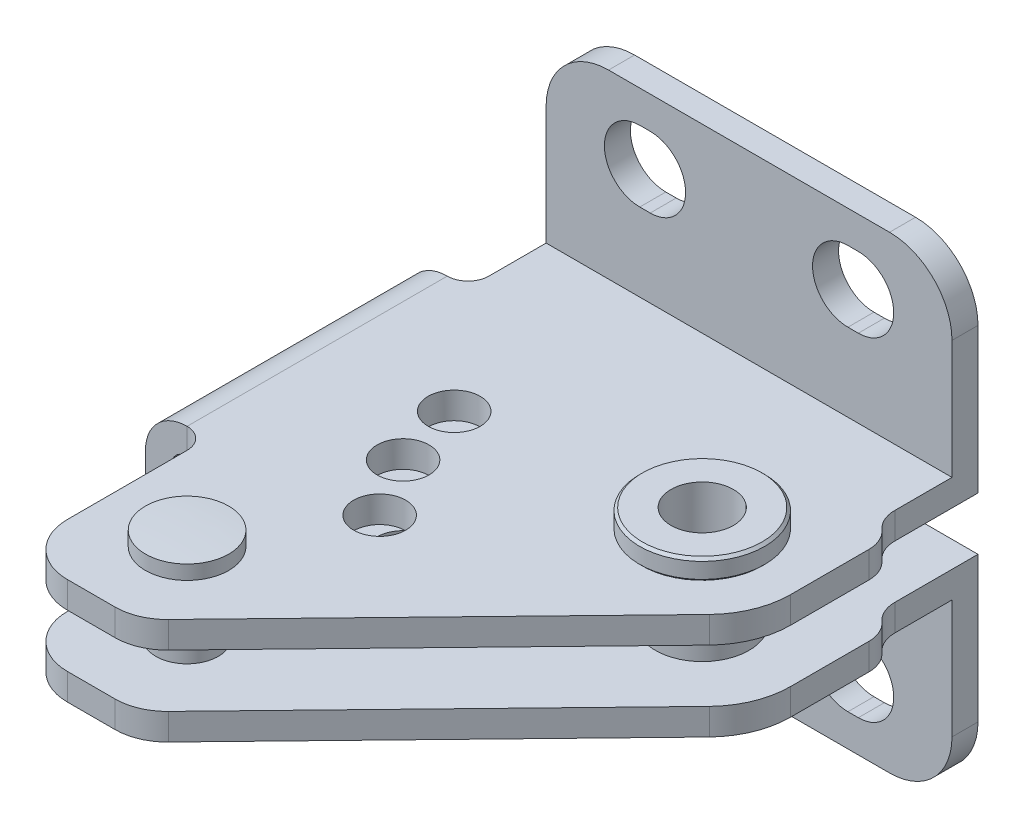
ISO-10303-21;
HEADER;
FILE_DESCRIPTION(('STEP AP214'),'2;1');
FILE_NAME('part.step','',(''),(''),'','','');
FILE_SCHEMA(('AUTOMOTIVE_DESIGN { 1 0 10303 214 1 1 1 1 }'));
ENDSEC;
DATA;
#1=APPLICATION_CONTEXT('core data for automotive mechanical design processes');
#2=APPLICATION_PROTOCOL_DEFINITION('international standard','automotive_design',2000,#1);
#3=PRODUCT_CONTEXT('',#1,'mechanical');
#4=PRODUCT('Part','Part','',(#3));
#5=PRODUCT_RELATED_PRODUCT_CATEGORY('part','',(#4));
#6=PRODUCT_DEFINITION_FORMATION('','',#4);
#7=PRODUCT_DEFINITION_CONTEXT('part definition',#1,'design');
#8=PRODUCT_DEFINITION('design','',#6,#7);
#9=PRODUCT_DEFINITION_SHAPE('','',#8);
#10=(LENGTH_UNIT() NAMED_UNIT(*) SI_UNIT(.MILLI.,.METRE.));
#11=(NAMED_UNIT(*) PLANE_ANGLE_UNIT() SI_UNIT($,.RADIAN.));
#12=(NAMED_UNIT(*) SI_UNIT($,.STERADIAN.) SOLID_ANGLE_UNIT());
#13=UNCERTAINTY_MEASURE_WITH_UNIT(LENGTH_MEASURE(1.E-05),#10,'distance_accuracy_value','');
#14=(GEOMETRIC_REPRESENTATION_CONTEXT(3) GLOBAL_UNCERTAINTY_ASSIGNED_CONTEXT((#13)) GLOBAL_UNIT_ASSIGNED_CONTEXT((#10,
#11,#12)) REPRESENTATION_CONTEXT('',''));
#15=CARTESIAN_POINT('',(0.,0.,0.));
#16=DIRECTION('',(0.,0.,1.));
#17=DIRECTION('',(1.,0.,0.));
#18=AXIS2_PLACEMENT_3D('',#15,#16,#17);
#19=CARTESIAN_POINT('',(22.5,10.9,19.));
#20=DIRECTION('',(0.,-1.,0.));
#21=DIRECTION('',(-1.,0.,0.));
#22=AXIS2_PLACEMENT_3D('',#19,#20,#21);
#23=CYLINDRICAL_SURFACE('',#22,6.);
#24=CARTESIAN_POINT('',(22.5,9.15,19.));
#25=DIRECTION('',(0.,-1.,0.));
#26=DIRECTION('',(0.,0.,1.));
#27=AXIS2_PLACEMENT_3D('',#24,#25,#26);
#28=CIRCLE('',#27,6.);
#29=CARTESIAN_POINT('',(22.5,9.15,25.));
#30=VERTEX_POINT('',#29);
#31=EDGE_CURVE('E485',#30,#30,#28,.F.);
#32=ORIENTED_EDGE('',*,*,#31,.T.);
#33=EDGE_LOOP('',(#32));
#34=FACE_BOUND('',#33,.T.);
#35=CARTESIAN_POINT('',(22.5,10.7,19.));
#36=DIRECTION('',(0.,-1.,0.));
#37=DIRECTION('',(-1.,0.,0.));
#38=AXIS2_PLACEMENT_3D('',#35,#36,#37);
#39=CIRCLE('',#38,6.);
#40=CARTESIAN_POINT('',(16.5,10.7,19.));
#41=VERTEX_POINT('',#40);
#42=EDGE_CURVE('E916',#41,#41,#39,.T.);
#43=ORIENTED_EDGE('',*,*,#42,.T.);
#44=EDGE_LOOP('',(#43));
#45=FACE_BOUND('',#44,.T.);
#46=ADVANCED_FACE('F14',(#34,#45),#23,.T.);
#47=CARTESIAN_POINT('',(-15.,10.9,10.));
#48=DIRECTION('',(-1.,0.,0.));
#49=DIRECTION('',(0.,-1.,0.));
#50=AXIS2_PLACEMENT_3D('',#47,#48,#49);
#51=PLANE('',#50);
#52=DIRECTION('',(0.,0.,-1.));
#53=VECTOR('',#52,1.);
#54=CARTESIAN_POINT('',(-15.,14.9000000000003,58.));
#55=LINE('',#54,#53);
#56=CARTESIAN_POINT('',(-15.,14.9000000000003,35.));
#57=VERTEX_POINT('',#56);
#58=CARTESIAN_POINT('',(-15.,14.9000000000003,10.));
#59=VERTEX_POINT('',#58);
#60=EDGE_CURVE('E647',#57,#59,#55,.T.);
#61=ORIENTED_EDGE('',*,*,#60,.F.);
#62=DIRECTION('',(0.,1.,0.));
#63=VECTOR('',#62,1.);
#64=CARTESIAN_POINT('',(-15.,10.9,35.));
#65=LINE('',#64,#63);
#66=CARTESIAN_POINT('',(-15.,17.1,35.));
#67=VERTEX_POINT('',#66);
#68=EDGE_CURVE('E850',#57,#67,#65,.T.);
#69=ORIENTED_EDGE('',*,*,#68,.T.);
#70=DIRECTION('',(0.,0.,-1.));
#71=VECTOR('',#70,1.);
#72=CARTESIAN_POINT('',(-15.,17.1,58.));
#73=LINE('',#72,#71);
#74=CARTESIAN_POINT('',(-15.,17.1,10.));
#75=VERTEX_POINT('',#74);
#76=EDGE_CURVE('E644',#67,#75,#73,.T.);
#77=ORIENTED_EDGE('',*,*,#76,.T.);
#78=DIRECTION('',(0.,1.,0.));
#79=VECTOR('',#78,1.);
#80=CARTESIAN_POINT('',(-15.,10.9,10.));
#81=LINE('',#80,#79);
#82=EDGE_CURVE('E853',#59,#75,#81,.T.);
#83=ORIENTED_EDGE('',*,*,#82,.F.);
#84=EDGE_LOOP('',(#61,#69,#77,#83));
#85=FACE_BOUND('',#84,.T.);
#86=ADVANCED_FACE('F951',(#85),#51,.T.);
#87=CARTESIAN_POINT('',(21.,3.4,2.5));
#88=DIRECTION('',(0.,-1.,0.));
#89=DIRECTION('',(1.,0.,0.));
#90=AXIS2_PLACEMENT_3D('',#87,#88,#89);
#91=PLANE('',#90);
#92=DIRECTION('',(-1.,0.,0.));
#93=VECTOR('',#92,1.);
#94=CARTESIAN_POINT('',(21.,3.4,0.));
#95=LINE('',#94,#93);
#96=CARTESIAN_POINT('',(21.,3.4,0.));
#97=VERTEX_POINT('',#96);
#98=CARTESIAN_POINT('',(20.,3.4,0.));
#99=VERTEX_POINT('',#98);
#100=EDGE_CURVE('E558',#97,#99,#95,.T.);
#101=ORIENTED_EDGE('',*,*,#100,.F.);
#102=DIRECTION('',(0.,0.,-1.));
#103=VECTOR('',#102,1.);
#104=CARTESIAN_POINT('',(21.,3.4,2.5));
#105=LINE('',#104,#103);
#106=CARTESIAN_POINT('',(21.,3.4,2.5));
#107=VERTEX_POINT('',#106);
#108=EDGE_CURVE('E583',#107,#97,#105,.T.);
#109=ORIENTED_EDGE('',*,*,#108,.F.);
#110=DIRECTION('',(-1.,0.,0.));
#111=VECTOR('',#110,1.);
#112=CARTESIAN_POINT('',(21.,3.4,2.5));
#113=LINE('',#112,#111);
#114=CARTESIAN_POINT('',(20.,3.4,2.5));
#115=VERTEX_POINT('',#114);
#116=EDGE_CURVE('E572',#107,#115,#113,.T.);
#117=ORIENTED_EDGE('',*,*,#116,.T.);
#118=DIRECTION('',(0.,0.,-1.));
#119=VECTOR('',#118,1.);
#120=CARTESIAN_POINT('',(20.,3.4,2.5));
#121=LINE('',#120,#119);
#122=EDGE_CURVE('E581',#115,#99,#121,.T.);
#123=ORIENTED_EDGE('',*,*,#122,.T.);
#124=EDGE_LOOP('',(#101,#109,#117,#123));
#125=FACE_BOUND('',#124,.T.);
#126=ADVANCED_FACE('F958',(#125),#91,.T.);
#127=CARTESIAN_POINT('',(21.,0.,2.5));
#128=DIRECTION('',(0.,0.,-1.));
#129=DIRECTION('',(0.,-1.,0.));
#130=AXIS2_PLACEMENT_3D('',#127,#128,#129);
#131=CYLINDRICAL_SURFACE('',#130,3.4);
#132=CARTESIAN_POINT('',(21.,0.,0.));
#133=DIRECTION('',(0.,0.,1.));
#134=DIRECTION('',(-1.,0.,0.));
#135=AXIS2_PLACEMENT_3D('',#132,#133,#134);
#136=CIRCLE('',#135,3.4);
#137=CARTESIAN_POINT('',(21.,-3.4,0.));
#138=VERTEX_POINT('',#137);
#139=EDGE_CURVE('E554',#138,#97,#136,.T.);
#140=ORIENTED_EDGE('',*,*,#139,.F.);
#141=DIRECTION('',(0.,0.,-1.));
#142=VECTOR('',#141,1.);
#143=CARTESIAN_POINT('',(21.,-3.4,2.5));
#144=LINE('',#143,#142);
#145=CARTESIAN_POINT('',(21.,-3.4,2.5));
#146=VERTEX_POINT('',#145);
#147=EDGE_CURVE('E585',#146,#138,#144,.T.);
#148=ORIENTED_EDGE('',*,*,#147,.F.);
#149=CARTESIAN_POINT('',(21.,0.,2.5));
#150=DIRECTION('',(0.,0.,1.));
#151=DIRECTION('',(-1.,0.,0.));
#152=AXIS2_PLACEMENT_3D('',#149,#150,#151);
#153=CIRCLE('',#152,3.4);
#154=EDGE_CURVE('E570',#146,#107,#153,.T.);
#155=ORIENTED_EDGE('',*,*,#154,.T.);
#156=ORIENTED_EDGE('',*,*,#108,.T.);
#157=EDGE_LOOP('',(#140,#148,#155,#156));
#158=FACE_BOUND('',#157,.T.);
#159=ADVANCED_FACE('F1162',(#158),#131,.F.);
#160=CARTESIAN_POINT('',(20.,-3.4,2.5));
#161=DIRECTION('',(0.,1.,0.));
#162=DIRECTION('',(-1.,0.,0.));
#163=AXIS2_PLACEMENT_3D('',#160,#161,#162);
#164=PLANE('',#163);
#165=DIRECTION('',(1.,0.,0.));
#166=VECTOR('',#165,1.);
#167=CARTESIAN_POINT('',(20.,-3.4,0.));
#168=LINE('',#167,#166);
#169=CARTESIAN_POINT('',(20.,-3.4,0.));
#170=VERTEX_POINT('',#169);
#171=EDGE_CURVE('E553',#170,#138,#168,.T.);
#172=ORIENTED_EDGE('',*,*,#171,.F.);
#173=DIRECTION('',(0.,0.,-1.));
#174=VECTOR('',#173,1.);
#175=CARTESIAN_POINT('',(20.,-3.4,2.5));
#176=LINE('',#175,#174);
#177=CARTESIAN_POINT('',(20.,-3.4,2.5));
#178=VERTEX_POINT('',#177);
#179=EDGE_CURVE('E577',#178,#170,#176,.T.);
#180=ORIENTED_EDGE('',*,*,#179,.F.);
#181=DIRECTION('',(1.,0.,0.));
#182=VECTOR('',#181,1.);
#183=CARTESIAN_POINT('',(20.,-3.4,2.5));
#184=LINE('',#183,#182);
#185=EDGE_CURVE('E566',#178,#146,#184,.T.);
#186=ORIENTED_EDGE('',*,*,#185,.T.);
#187=ORIENTED_EDGE('',*,*,#147,.T.);
#188=EDGE_LOOP('',(#172,#180,#186,#187));
#189=FACE_BOUND('',#188,.T.);
#190=ADVANCED_FACE('F1167',(#189),#164,.T.);
#191=CARTESIAN_POINT('',(20.,0.,2.5));
#192=DIRECTION('',(0.,0.,-1.));
#193=DIRECTION('',(0.,-1.,0.));
#194=AXIS2_PLACEMENT_3D('',#191,#192,#193);
#195=CYLINDRICAL_SURFACE('',#194,3.4);
#196=CARTESIAN_POINT('',(20.,0.,0.));
#197=DIRECTION('',(0.,0.,1.));
#198=DIRECTION('',(1.,0.,0.));
#199=AXIS2_PLACEMENT_3D('',#196,#197,#198);
#200=CIRCLE('',#199,3.4);
#201=EDGE_CURVE('E562',#99,#170,#200,.T.);
#202=ORIENTED_EDGE('',*,*,#201,.F.);
#203=ORIENTED_EDGE('',*,*,#122,.F.);
#204=CARTESIAN_POINT('',(20.,0.,2.5));
#205=DIRECTION('',(0.,0.,1.));
#206=DIRECTION('',(1.,0.,0.));
#207=AXIS2_PLACEMENT_3D('',#204,#205,#206);
#208=CIRCLE('',#207,3.4);
#209=EDGE_CURVE('E575',#115,#178,#208,.T.);
#210=ORIENTED_EDGE('',*,*,#209,.T.);
#211=ORIENTED_EDGE('',*,*,#179,.T.);
#212=EDGE_LOOP('',(#202,#203,#210,#211));
#213=FACE_BOUND('',#212,.T.);
#214=ADVANCED_FACE('F1170',(#213),#195,.F.);
#215=CARTESIAN_POINT('',(-2.99999999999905,-0.49999999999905,2.5));
#216=DIRECTION('',(0.,0.,-1.));
#217=DIRECTION('',(0.,-1.,0.));
#218=AXIS2_PLACEMENT_3D('',#215,#216,#217);
#219=CYLINDRICAL_SURFACE('',#218,6.00000000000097);
#220=CARTESIAN_POINT('',(-2.99999999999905,-0.49999999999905,0.));
#221=DIRECTION('',(0.,0.,1.));
#222=DIRECTION('',(-1.,0.,0.));
#223=AXIS2_PLACEMENT_3D('',#220,#221,#222);
#224=CIRCLE('',#223,6.00000000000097);
#225=CARTESIAN_POINT('',(-9.,-0.5,0.));
#226=VERTEX_POINT('',#225);
#227=CARTESIAN_POINT('',(-3.,-6.5,0.));
#228=VERTEX_POINT('',#227);
#229=EDGE_CURVE('E697',#226,#228,#224,.T.);
#230=ORIENTED_EDGE('',*,*,#229,.T.);
#231=DIRECTION('',(0.,0.,-1.));
#232=VECTOR('',#231,1.);
#233=CARTESIAN_POINT('',(-3.,-6.5,2.5));
#234=LINE('',#233,#232);
#235=CARTESIAN_POINT('',(-3.,-6.5,2.5));
#236=VERTEX_POINT('',#235);
#237=EDGE_CURVE('E732',#236,#228,#234,.T.);
#238=ORIENTED_EDGE('',*,*,#237,.F.);
#239=CARTESIAN_POINT('',(-2.99999999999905,-0.49999999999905,2.5));
#240=DIRECTION('',(0.,0.,1.));
#241=DIRECTION('',(-1.,0.,0.));
#242=AXIS2_PLACEMENT_3D('',#239,#240,#241);
#243=CIRCLE('',#242,6.00000000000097);
#244=CARTESIAN_POINT('',(-9.,-0.5,2.5));
#245=VERTEX_POINT('',#244);
#246=EDGE_CURVE('E719',#245,#236,#243,.T.);
#247=ORIENTED_EDGE('',*,*,#246,.F.);
#248=DIRECTION('',(0.,0.,-1.));
#249=VECTOR('',#248,1.);
#250=CARTESIAN_POINT('',(-9.,-0.5,2.5));
#251=LINE('',#250,#249);
#252=EDGE_CURVE('E735',#245,#226,#251,.T.);
#253=ORIENTED_EDGE('',*,*,#252,.T.);
#254=EDGE_LOOP('',(#230,#238,#247,#253));
#255=FACE_BOUND('',#254,.T.);
#256=ADVANCED_FACE('F1145',(#255),#219,.T.);
#257=CARTESIAN_POINT('',(-3.,-6.5,2.5));
#258=DIRECTION('',(0.,1.,0.));
#259=DIRECTION('',(-1.,0.,0.));
#260=AXIS2_PLACEMENT_3D('',#257,#258,#259);
#261=PLANE('',#260);
#262=DIRECTION('',(1.,0.,0.));
#263=VECTOR('',#262,1.);
#264=CARTESIAN_POINT('',(-3.,-6.5,0.));
#265=LINE('',#264,#263);
#266=CARTESIAN_POINT('',(24.,-6.5,0.));
#267=VERTEX_POINT('',#266);
#268=EDGE_CURVE('E700',#228,#267,#265,.T.);
#269=ORIENTED_EDGE('',*,*,#268,.T.);
#270=DIRECTION('',(0.,0.,-1.));
#271=VECTOR('',#270,1.);
#272=CARTESIAN_POINT('',(24.,-6.5,2.5));
#273=LINE('',#272,#271);
#274=CARTESIAN_POINT('',(24.,-6.5,2.5));
#275=VERTEX_POINT('',#274);
#276=EDGE_CURVE('E729',#275,#267,#273,.T.);
#277=ORIENTED_EDGE('',*,*,#276,.F.);
#278=DIRECTION('',(1.,0.,0.));
#279=VECTOR('',#278,1.);
#280=CARTESIAN_POINT('',(-3.,-6.5,2.5));
#281=LINE('',#280,#279);
#282=EDGE_CURVE('E721',#236,#275,#281,.T.);
#283=ORIENTED_EDGE('',*,*,#282,.F.);
#284=ORIENTED_EDGE('',*,*,#237,.T.);
#285=EDGE_LOOP('',(#269,#277,#283,#284));
#286=FACE_BOUND('',#285,.T.);
#287=ADVANCED_FACE('F1141',(#286),#261,.F.);
#288=CARTESIAN_POINT('',(1.,3.4,2.5));
#289=DIRECTION('',(0.,-1.,0.));
#290=DIRECTION('',(1.,0.,0.));
#291=AXIS2_PLACEMENT_3D('',#288,#289,#290);
#292=PLANE('',#291);
#293=DIRECTION('',(-1.,0.,0.));
#294=VECTOR('',#293,1.);
#295=CARTESIAN_POINT('',(1.,3.4,0.));
#296=LINE('',#295,#294);
#297=CARTESIAN_POINT('',(1.,3.4,0.));
#298=VERTEX_POINT('',#297);
#299=CARTESIAN_POINT('',(0.,3.4,0.));
#300=VERTEX_POINT('',#299);
#301=EDGE_CURVE('E593',#298,#300,#296,.T.);
#302=ORIENTED_EDGE('',*,*,#301,.F.);
#303=DIRECTION('',(0.,0.,-1.));
#304=VECTOR('',#303,1.);
#305=CARTESIAN_POINT('',(1.,3.4,2.5));
#306=LINE('',#305,#304);
#307=CARTESIAN_POINT('',(1.,3.4,2.5));
#308=VERTEX_POINT('',#307);
#309=EDGE_CURVE('E618',#308,#298,#306,.T.);
#310=ORIENTED_EDGE('',*,*,#309,.F.);
#311=DIRECTION('',(-1.,0.,0.));
#312=VECTOR('',#311,1.);
#313=CARTESIAN_POINT('',(1.,3.4,2.5));
#314=LINE('',#313,#312);
#315=CARTESIAN_POINT('',(0.,3.4,2.5));
#316=VERTEX_POINT('',#315);
#317=EDGE_CURVE('E607',#308,#316,#314,.T.);
#318=ORIENTED_EDGE('',*,*,#317,.T.);
#319=DIRECTION('',(0.,0.,-1.));
#320=VECTOR('',#319,1.);
#321=CARTESIAN_POINT('',(0.,3.4,2.5));
#322=LINE('',#321,#320);
#323=EDGE_CURVE('E616',#316,#300,#322,.T.);
#324=ORIENTED_EDGE('',*,*,#323,.T.);
#325=EDGE_LOOP('',(#302,#310,#318,#324));
#326=FACE_BOUND('',#325,.T.);
#327=ADVANCED_FACE('F1192',(#326),#292,.T.);
#328=CARTESIAN_POINT('',(1.,0.,2.5));
#329=DIRECTION('',(0.,0.,-1.));
#330=DIRECTION('',(0.,-1.,0.));
#331=AXIS2_PLACEMENT_3D('',#328,#329,#330);
#332=CYLINDRICAL_SURFACE('',#331,3.4);
#333=CARTESIAN_POINT('',(1.,0.,0.));
#334=DIRECTION('',(0.,0.,1.));
#335=DIRECTION('',(-1.,0.,0.));
#336=AXIS2_PLACEMENT_3D('',#333,#334,#335);
#337=CIRCLE('',#336,3.4);
#338=CARTESIAN_POINT('',(1.,-3.4,0.));
#339=VERTEX_POINT('',#338);
#340=EDGE_CURVE('E589',#339,#298,#337,.T.);
#341=ORIENTED_EDGE('',*,*,#340,.F.);
#342=DIRECTION('',(0.,0.,-1.));
#343=VECTOR('',#342,1.);
#344=CARTESIAN_POINT('',(1.,-3.4,2.5));
#345=LINE('',#344,#343);
#346=CARTESIAN_POINT('',(1.,-3.4,2.5));
#347=VERTEX_POINT('',#346);
#348=EDGE_CURVE('E620',#347,#339,#345,.T.);
#349=ORIENTED_EDGE('',*,*,#348,.F.);
#350=CARTESIAN_POINT('',(1.,0.,2.5));
#351=DIRECTION('',(0.,0.,1.));
#352=DIRECTION('',(-1.,0.,0.));
#353=AXIS2_PLACEMENT_3D('',#350,#351,#352);
#354=CIRCLE('',#353,3.4);
#355=EDGE_CURVE('E605',#347,#308,#354,.T.);
#356=ORIENTED_EDGE('',*,*,#355,.T.);
#357=ORIENTED_EDGE('',*,*,#309,.T.);
#358=EDGE_LOOP('',(#341,#349,#356,#357));
#359=FACE_BOUND('',#358,.T.);
#360=ADVANCED_FACE('F1195',(#359),#332,.F.);
#361=CARTESIAN_POINT('',(0.,-3.4,2.5));
#362=DIRECTION('',(0.,1.,0.));
#363=DIRECTION('',(-1.,0.,0.));
#364=AXIS2_PLACEMENT_3D('',#361,#362,#363);
#365=PLANE('',#364);
#366=DIRECTION('',(1.,0.,0.));
#367=VECTOR('',#366,1.);
#368=CARTESIAN_POINT('',(0.,-3.4,0.));
#369=LINE('',#368,#367);
#370=CARTESIAN_POINT('',(0.,-3.4,0.));
#371=VERTEX_POINT('',#370);
#372=EDGE_CURVE('E588',#371,#339,#369,.T.);
#373=ORIENTED_EDGE('',*,*,#372,.F.);
#374=DIRECTION('',(0.,0.,-1.));
#375=VECTOR('',#374,1.);
#376=CARTESIAN_POINT('',(0.,-3.4,2.5));
#377=LINE('',#376,#375);
#378=CARTESIAN_POINT('',(0.,-3.4,2.5));
#379=VERTEX_POINT('',#378);
#380=EDGE_CURVE('E612',#379,#371,#377,.T.);
#381=ORIENTED_EDGE('',*,*,#380,.F.);
#382=DIRECTION('',(1.,0.,0.));
#383=VECTOR('',#382,1.);
#384=CARTESIAN_POINT('',(0.,-3.4,2.5));
#385=LINE('',#384,#383);
#386=EDGE_CURVE('E601',#379,#347,#385,.T.);
#387=ORIENTED_EDGE('',*,*,#386,.T.);
#388=ORIENTED_EDGE('',*,*,#348,.T.);
#389=EDGE_LOOP('',(#373,#381,#387,#388));
#390=FACE_BOUND('',#389,.T.);
#391=ADVANCED_FACE('F1190',(#390),#365,.T.);
#392=CARTESIAN_POINT('',(0.,0.,2.5));
#393=DIRECTION('',(0.,0.,-1.));
#394=DIRECTION('',(0.,-1.,0.));
#395=AXIS2_PLACEMENT_3D('',#392,#393,#394);
#396=CYLINDRICAL_SURFACE('',#395,3.4);
#397=CARTESIAN_POINT('',(0.,0.,0.));
#398=DIRECTION('',(0.,0.,1.));
#399=DIRECTION('',(1.,0.,0.));
#400=AXIS2_PLACEMENT_3D('',#397,#398,#399);
#401=CIRCLE('',#400,3.4);
#402=EDGE_CURVE('E597',#300,#371,#401,.T.);
#403=ORIENTED_EDGE('',*,*,#402,.F.);
#404=ORIENTED_EDGE('',*,*,#323,.F.);
#405=CARTESIAN_POINT('',(0.,0.,2.5));
#406=DIRECTION('',(0.,0.,1.));
#407=DIRECTION('',(1.,0.,0.));
#408=AXIS2_PLACEMENT_3D('',#405,#406,#407);
#409=CIRCLE('',#408,3.4);
#410=EDGE_CURVE('E610',#316,#379,#409,.T.);
#411=ORIENTED_EDGE('',*,*,#410,.T.);
#412=ORIENTED_EDGE('',*,*,#380,.T.);
#413=EDGE_LOOP('',(#403,#404,#411,#412));
#414=FACE_BOUND('',#413,.T.);
#415=ADVANCED_FACE('F1187',(#414),#396,.F.);
#416=CARTESIAN_POINT('',(23.9999999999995,-0.499999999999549,2.5));
#417=DIRECTION('',(0.,0.,-1.));
#418=DIRECTION('',(0.,-1.,0.));
#419=AXIS2_PLACEMENT_3D('',#416,#417,#418);
#420=CYLINDRICAL_SURFACE('',#419,6.00000000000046);
#421=CARTESIAN_POINT('',(23.9999999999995,-0.499999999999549,0.));
#422=DIRECTION('',(0.,0.,1.));
#423=DIRECTION('',(-1.,0.,0.));
#424=AXIS2_PLACEMENT_3D('',#421,#422,#423);
#425=CIRCLE('',#424,6.00000000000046);
#426=CARTESIAN_POINT('',(30.,-0.5,0.));
#427=VERTEX_POINT('',#426);
#428=EDGE_CURVE('E703',#267,#427,#425,.T.);
#429=ORIENTED_EDGE('',*,*,#428,.T.);
#430=DIRECTION('',(0.,0.,-1.));
#431=VECTOR('',#430,1.);
#432=CARTESIAN_POINT('',(30.,-0.5,2.5));
#433=LINE('',#432,#431);
#434=CARTESIAN_POINT('',(30.,-0.5,2.5));
#435=VERTEX_POINT('',#434);
#436=EDGE_CURVE('E725',#435,#427,#433,.T.);
#437=ORIENTED_EDGE('',*,*,#436,.F.);
#438=CARTESIAN_POINT('',(23.9999999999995,-0.499999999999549,2.5));
#439=DIRECTION('',(0.,0.,1.));
#440=DIRECTION('',(-1.,0.,0.));
#441=AXIS2_PLACEMENT_3D('',#438,#439,#440);
#442=CIRCLE('',#441,6.00000000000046);
#443=EDGE_CURVE('E723',#275,#435,#442,.T.);
#444=ORIENTED_EDGE('',*,*,#443,.F.);
#445=ORIENTED_EDGE('',*,*,#276,.T.);
#446=EDGE_LOOP('',(#429,#437,#444,#445));
#447=FACE_BOUND('',#446,.T.);
#448=ADVANCED_FACE('F1136',(#447),#420,.T.);
#449=CARTESIAN_POINT('',(-11.,10.9,10.));
#450=DIRECTION('',(0.,0.,-1.));
#451=DIRECTION('',(0.,-1.,0.));
#452=AXIS2_PLACEMENT_3D('',#449,#450,#451);
#453=PLANE('',#452);
#454=DIRECTION('',(0.,1.,0.));
#455=VECTOR('',#454,1.);
#456=CARTESIAN_POINT('',(-11.,10.9,10.));
#457=LINE('',#456,#455);
#458=CARTESIAN_POINT('',(-11.,10.9,10.));
#459=VERTEX_POINT('',#458);
#460=CARTESIAN_POINT('',(-11.,13.4,10.));
#461=VERTEX_POINT('',#460);
#462=EDGE_CURVE('E420',#459,#461,#457,.T.);
#463=ORIENTED_EDGE('',*,*,#462,.F.);
#464=CARTESIAN_POINT('',(-11.,14.9000000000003,10.));
#465=DIRECTION('',(0.,0.,-1.));
#466=DIRECTION('',(0.,-1.,0.));
#467=AXIS2_PLACEMENT_3D('',#464,#465,#466);
#468=CIRCLE('',#467,4.0000000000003);
#469=EDGE_CURVE('E661',#459,#59,#468,.T.);
#470=ORIENTED_EDGE('',*,*,#469,.T.);
#471=ORIENTED_EDGE('',*,*,#82,.T.);
#472=CARTESIAN_POINT('',(-11.,17.0999999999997,10.));
#473=DIRECTION('',(0.,0.,-1.));
#474=DIRECTION('',(0.,-1.,0.));
#475=AXIS2_PLACEMENT_3D('',#472,#473,#474);
#476=CIRCLE('',#475,4.0000000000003);
#477=CARTESIAN_POINT('',(-11.,21.1,10.));
#478=VERTEX_POINT('',#477);
#479=EDGE_CURVE('E655',#75,#478,#476,.T.);
#480=ORIENTED_EDGE('',*,*,#479,.T.);
#481=CARTESIAN_POINT('',(-11.,18.6,10.));
#482=VERTEX_POINT('',#481);
#483=EDGE_CURVE('E856',#482,#478,#457,.T.);
#484=ORIENTED_EDGE('',*,*,#483,.F.);
#485=CARTESIAN_POINT('',(-11.,17.1000000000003,10.));
#486=DIRECTION('',(0.,0.,-1.));
#487=DIRECTION('',(0.,-1.,0.));
#488=AXIS2_PLACEMENT_3D('',#485,#486,#487);
#489=CIRCLE('',#488,1.49999999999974);
#490=CARTESIAN_POINT('',(-12.5,17.1,10.));
#491=VERTEX_POINT('',#490);
#492=EDGE_CURVE('E684',#482,#491,#489,.F.);
#493=ORIENTED_EDGE('',*,*,#492,.T.);
#494=DIRECTION('',(0.,-1.,0.));
#495=VECTOR('',#494,1.);
#496=CARTESIAN_POINT('',(-12.5,10.9,10.));
#497=LINE('',#496,#495);
#498=CARTESIAN_POINT('',(-12.5,14.9,10.));
#499=VERTEX_POINT('',#498);
#500=EDGE_CURVE('E681',#491,#499,#497,.T.);
#501=ORIENTED_EDGE('',*,*,#500,.T.);
#502=CARTESIAN_POINT('',(-11.,14.8999999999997,10.));
#503=DIRECTION('',(0.,0.,-1.));
#504=DIRECTION('',(0.,-1.,0.));
#505=AXIS2_PLACEMENT_3D('',#502,#503,#504);
#506=CIRCLE('',#505,1.49999999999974);
#507=EDGE_CURVE('E678',#499,#461,#506,.F.);
#508=ORIENTED_EDGE('',*,*,#507,.T.);
#509=EDGE_LOOP('',(#463,#470,#471,#480,#484,#493,#501,#508));
#510=FACE_BOUND('',#509,.T.);
#511=ADVANCED_FACE('F1073',(#510),#453,.T.);
#512=CARTESIAN_POINT('',(-12.5,17.1,55.5));
#513=DIRECTION('',(1.,0.,0.));
#514=DIRECTION('',(0.,1.,0.));
#515=AXIS2_PLACEMENT_3D('',#512,#513,#514);
#516=PLANE('',#515);
#517=DIRECTION('',(0.,0.,-1.));
#518=VECTOR('',#517,1.);
#519=CARTESIAN_POINT('',(-12.5,17.1,55.5));
#520=LINE('',#519,#518);
#521=CARTESIAN_POINT('',(-12.5,17.1,35.));
#522=VERTEX_POINT('',#521);
#523=EDGE_CURVE('E669',#522,#491,#520,.T.);
#524=ORIENTED_EDGE('',*,*,#523,.F.);
#525=DIRECTION('',(0.,1.,0.));
#526=VECTOR('',#525,1.);
#527=CARTESIAN_POINT('',(-12.5,10.9,35.));
#528=LINE('',#527,#526);
#529=CARTESIAN_POINT('',(-12.5,14.9,35.));
#530=VERTEX_POINT('',#529);
#531=EDGE_CURVE('E881',#530,#522,#528,.T.);
#532=ORIENTED_EDGE('',*,*,#531,.F.);
#533=DIRECTION('',(0.,0.,-1.));
#534=VECTOR('',#533,1.);
#535=CARTESIAN_POINT('',(-12.5,14.9,55.5));
#536=LINE('',#535,#534);
#537=EDGE_CURVE('E666',#530,#499,#536,.T.);
#538=ORIENTED_EDGE('',*,*,#537,.T.);
#539=ORIENTED_EDGE('',*,*,#500,.F.);
#540=EDGE_LOOP('',(#524,#532,#538,#539));
#541=FACE_BOUND('',#540,.T.);
#542=ADVANCED_FACE('F1081',(#541),#516,.T.);
#543=CARTESIAN_POINT('',(-15.,10.9,35.));
#544=DIRECTION('',(0.,0.,1.));
#545=DIRECTION('',(0.,1.,0.));
#546=AXIS2_PLACEMENT_3D('',#543,#544,#545);
#547=PLANE('',#546);
#548=ORIENTED_EDGE('',*,*,#68,.F.);
#549=CARTESIAN_POINT('',(-11.,14.9000000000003,35.));
#550=DIRECTION('',(0.,0.,1.));
#551=DIRECTION('',(0.,1.,0.));
#552=AXIS2_PLACEMENT_3D('',#549,#550,#551);
#553=CIRCLE('',#552,4.0000000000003);
#554=CARTESIAN_POINT('',(-11.,10.9,35.));
#555=VERTEX_POINT('',#554);
#556=EDGE_CURVE('E658',#57,#555,#553,.T.);
#557=ORIENTED_EDGE('',*,*,#556,.T.);
#558=DIRECTION('',(0.,1.,0.));
#559=VECTOR('',#558,1.);
#560=CARTESIAN_POINT('',(-11.,10.9,35.));
#561=LINE('',#560,#559);
#562=CARTESIAN_POINT('',(-11.,13.4,35.));
#563=VERTEX_POINT('',#562);
#564=EDGE_CURVE('E847',#555,#563,#561,.T.);
#565=ORIENTED_EDGE('',*,*,#564,.T.);
#566=CARTESIAN_POINT('',(-11.,14.8999999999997,35.));
#567=DIRECTION('',(0.,0.,1.));
#568=DIRECTION('',(0.,1.,0.));
#569=AXIS2_PLACEMENT_3D('',#566,#567,#568);
#570=CIRCLE('',#569,1.49999999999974);
#571=EDGE_CURVE('E675',#563,#530,#570,.F.);
#572=ORIENTED_EDGE('',*,*,#571,.T.);
#573=ORIENTED_EDGE('',*,*,#531,.T.);
#574=CARTESIAN_POINT('',(-11.,17.1000000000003,35.));
#575=DIRECTION('',(0.,0.,1.));
#576=DIRECTION('',(0.,1.,0.));
#577=AXIS2_PLACEMENT_3D('',#574,#575,#576);
#578=CIRCLE('',#577,1.49999999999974);
#579=CARTESIAN_POINT('',(-11.,18.6,35.));
#580=VERTEX_POINT('',#579);
#581=EDGE_CURVE('E884',#522,#580,#578,.F.);
#582=ORIENTED_EDGE('',*,*,#581,.T.);
#583=CARTESIAN_POINT('',(-11.,21.1,35.));
#584=VERTEX_POINT('',#583);
#585=EDGE_CURVE('E846',#580,#584,#561,.T.);
#586=ORIENTED_EDGE('',*,*,#585,.T.);
#587=CARTESIAN_POINT('',(-11.,17.0999999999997,35.));
#588=DIRECTION('',(0.,0.,1.));
#589=DIRECTION('',(0.,1.,0.));
#590=AXIS2_PLACEMENT_3D('',#587,#588,#589);
#591=CIRCLE('',#590,4.0000000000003);
#592=EDGE_CURVE('E652',#584,#67,#591,.T.);
#593=ORIENTED_EDGE('',*,*,#592,.T.);
#594=EDGE_LOOP('',(#548,#557,#565,#572,#573,#582,#586,#593));
#595=FACE_BOUND('',#594,.T.);
#596=ADVANCED_FACE('F1084',(#595),#547,.T.);
#597=CARTESIAN_POINT('',(21.,35.4,2.5));
#598=DIRECTION('',(0.,-1.,0.));
#599=DIRECTION('',(1.,0.,0.));
#600=AXIS2_PLACEMENT_3D('',#597,#598,#599);
#601=PLANE('',#600);
#602=DIRECTION('',(-1.,0.,0.));
#603=VECTOR('',#602,1.);
#604=CARTESIAN_POINT('',(21.,35.4,0.));
#605=LINE('',#604,#603);
#606=CARTESIAN_POINT('',(21.,35.4,0.));
#607=VERTEX_POINT('',#606);
#608=CARTESIAN_POINT('',(20.,35.4,0.));
#609=VERTEX_POINT('',#608);
#610=EDGE_CURVE('E490',#607,#609,#605,.T.);
#611=ORIENTED_EDGE('',*,*,#610,.F.);
#612=DIRECTION('',(0.,0.,-1.));
#613=VECTOR('',#612,1.);
#614=CARTESIAN_POINT('',(21.,35.4,2.5));
#615=LINE('',#614,#613);
#616=CARTESIAN_POINT('',(21.,35.4,2.5));
#617=VERTEX_POINT('',#616);
#618=EDGE_CURVE('E514',#617,#607,#615,.T.);
#619=ORIENTED_EDGE('',*,*,#618,.F.);
#620=DIRECTION('',(-1.,0.,0.));
#621=VECTOR('',#620,1.);
#622=CARTESIAN_POINT('',(21.,35.4,2.5));
#623=LINE('',#622,#621);
#624=CARTESIAN_POINT('',(20.,35.4,2.5));
#625=VERTEX_POINT('',#624);
#626=EDGE_CURVE('E504',#617,#625,#623,.T.);
#627=ORIENTED_EDGE('',*,*,#626,.T.);
#628=DIRECTION('',(0.,0.,-1.));
#629=VECTOR('',#628,1.);
#630=CARTESIAN_POINT('',(20.,35.4,2.5));
#631=LINE('',#630,#629);
#632=EDGE_CURVE('E512',#625,#609,#631,.T.);
#633=ORIENTED_EDGE('',*,*,#632,.T.);
#634=EDGE_LOOP('',(#611,#619,#627,#633));
#635=FACE_BOUND('',#634,.T.);
#636=ADVANCED_FACE('F1294',(#635),#601,.T.);
#637=CARTESIAN_POINT('',(21.,32.,2.5));
#638=DIRECTION('',(0.,0.,-1.));
#639=DIRECTION('',(0.,-1.,0.));
#640=AXIS2_PLACEMENT_3D('',#637,#638,#639);
#641=CYLINDRICAL_SURFACE('',#640,3.4);
#642=CARTESIAN_POINT('',(21.,32.,0.));
#643=DIRECTION('',(0.,0.,1.));
#644=DIRECTION('',(-1.,0.,0.));
#645=AXIS2_PLACEMENT_3D('',#642,#643,#644);
#646=CIRCLE('',#645,3.4);
#647=CARTESIAN_POINT('',(21.,28.6,0.));
#648=VERTEX_POINT('',#647);
#649=EDGE_CURVE('E486',#648,#607,#646,.T.);
#650=ORIENTED_EDGE('',*,*,#649,.F.);
#651=DIRECTION('',(0.,0.,-1.));
#652=VECTOR('',#651,1.);
#653=CARTESIAN_POINT('',(21.,28.6,2.5));
#654=LINE('',#653,#652);
#655=CARTESIAN_POINT('',(21.,28.6,2.5));
#656=VERTEX_POINT('',#655);
#657=EDGE_CURVE('E516',#656,#648,#654,.T.);
#658=ORIENTED_EDGE('',*,*,#657,.F.);
#659=CARTESIAN_POINT('',(21.,32.,2.5));
#660=DIRECTION('',(0.,0.,1.));
#661=DIRECTION('',(-1.,0.,0.));
#662=AXIS2_PLACEMENT_3D('',#659,#660,#661);
#663=CIRCLE('',#662,3.4);
#664=EDGE_CURVE('E502',#656,#617,#663,.T.);
#665=ORIENTED_EDGE('',*,*,#664,.T.);
#666=ORIENTED_EDGE('',*,*,#618,.T.);
#667=EDGE_LOOP('',(#650,#658,#665,#666));
#668=FACE_BOUND('',#667,.T.);
#669=ADVANCED_FACE('F1889',(#668),#641,.F.);
#670=CARTESIAN_POINT('',(20.,28.6,2.5));
#671=DIRECTION('',(0.,1.,0.));
#672=DIRECTION('',(-1.,0.,0.));
#673=AXIS2_PLACEMENT_3D('',#670,#671,#672);
#674=PLANE('',#673);
#675=DIRECTION('',(1.,0.,0.));
#676=VECTOR('',#675,1.);
#677=CARTESIAN_POINT('',(20.,28.6,0.));
#678=LINE('',#677,#676);
#679=CARTESIAN_POINT('',(20.,28.6,0.));
#680=VERTEX_POINT('',#679);
#681=EDGE_CURVE('E32',#680,#648,#678,.T.);
#682=ORIENTED_EDGE('',*,*,#681,.F.);
#683=DIRECTION('',(0.,0.,-1.));
#684=VECTOR('',#683,1.);
#685=CARTESIAN_POINT('',(20.,28.6,2.5));
#686=LINE('',#685,#684);
#687=CARTESIAN_POINT('',(20.,28.6,2.5));
#688=VERTEX_POINT('',#687);
#689=EDGE_CURVE('E509',#688,#680,#686,.T.);
#690=ORIENTED_EDGE('',*,*,#689,.F.);
#691=DIRECTION('',(1.,0.,0.));
#692=VECTOR('',#691,1.);
#693=CARTESIAN_POINT('',(20.,28.6,2.5));
#694=LINE('',#693,#692);
#695=EDGE_CURVE('E498',#688,#656,#694,.T.);
#696=ORIENTED_EDGE('',*,*,#695,.T.);
#697=ORIENTED_EDGE('',*,*,#657,.T.);
#698=EDGE_LOOP('',(#682,#690,#696,#697));
#699=FACE_BOUND('',#698,.T.);
#700=ADVANCED_FACE('F1878',(#699),#674,.T.);
#701=CARTESIAN_POINT('',(20.,32.,2.5));
#702=DIRECTION('',(0.,0.,-1.));
#703=DIRECTION('',(0.,-1.,0.));
#704=AXIS2_PLACEMENT_3D('',#701,#702,#703);
#705=CYLINDRICAL_SURFACE('',#704,3.4);
#706=CARTESIAN_POINT('',(20.,32.,0.));
#707=DIRECTION('',(0.,0.,1.));
#708=DIRECTION('',(1.,0.,0.));
#709=AXIS2_PLACEMENT_3D('',#706,#707,#708);
#710=CIRCLE('',#709,3.4);
#711=EDGE_CURVE('E494',#609,#680,#710,.T.);
#712=ORIENTED_EDGE('',*,*,#711,.F.);
#713=ORIENTED_EDGE('',*,*,#632,.F.);
#714=CARTESIAN_POINT('',(20.,32.,2.5));
#715=DIRECTION('',(0.,0.,1.));
#716=DIRECTION('',(1.,0.,0.));
#717=AXIS2_PLACEMENT_3D('',#714,#715,#716);
#718=CIRCLE('',#717,3.4);
#719=EDGE_CURVE('E507',#625,#688,#718,.T.);
#720=ORIENTED_EDGE('',*,*,#719,.T.);
#721=ORIENTED_EDGE('',*,*,#689,.T.);
#722=EDGE_LOOP('',(#712,#713,#720,#721));
#723=FACE_BOUND('',#722,.T.);
#724=ADVANCED_FACE('F1265',(#723),#705,.F.);
#725=CARTESIAN_POINT('',(23.9999999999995,32.4999999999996,2.5));
#726=DIRECTION('',(0.,0.,-1.));
#727=DIRECTION('',(0.,-1.,0.));
#728=AXIS2_PLACEMENT_3D('',#725,#726,#727);
#729=CYLINDRICAL_SURFACE('',#728,6.00000000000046);
#730=CARTESIAN_POINT('',(23.9999999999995,32.4999999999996,0.));
#731=DIRECTION('',(0.,0.,1.));
#732=DIRECTION('',(-1.,0.,0.));
#733=AXIS2_PLACEMENT_3D('',#730,#731,#732);
#734=CIRCLE('',#733,6.00000000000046);
#735=CARTESIAN_POINT('',(30.,32.5,0.));
#736=VERTEX_POINT('',#735);
#737=CARTESIAN_POINT('',(24.,38.5,0.));
#738=VERTEX_POINT('',#737);
#739=EDGE_CURVE('E687',#736,#738,#734,.T.);
#740=ORIENTED_EDGE('',*,*,#739,.T.);
#741=DIRECTION('',(0.,0.,-1.));
#742=VECTOR('',#741,1.);
#743=CARTESIAN_POINT('',(24.,38.5,2.5));
#744=LINE('',#743,#742);
#745=CARTESIAN_POINT('',(24.,38.5,2.5));
#746=VERTEX_POINT('',#745);
#747=EDGE_CURVE('E744',#746,#738,#744,.T.);
#748=ORIENTED_EDGE('',*,*,#747,.F.);
#749=CARTESIAN_POINT('',(23.9999999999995,32.4999999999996,2.5));
#750=DIRECTION('',(0.,0.,1.));
#751=DIRECTION('',(-1.,0.,0.));
#752=AXIS2_PLACEMENT_3D('',#749,#750,#751);
#753=CIRCLE('',#752,6.00000000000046);
#754=CARTESIAN_POINT('',(30.,32.5,2.5));
#755=VERTEX_POINT('',#754);
#756=EDGE_CURVE('E708',#755,#746,#753,.T.);
#757=ORIENTED_EDGE('',*,*,#756,.F.);
#758=DIRECTION('',(0.,0.,-1.));
#759=VECTOR('',#758,1.);
#760=CARTESIAN_POINT('',(30.,32.5,2.5));
#761=LINE('',#760,#759);
#762=EDGE_CURVE('E747',#755,#736,#761,.T.);
#763=ORIENTED_EDGE('',*,*,#762,.T.);
#764=EDGE_LOOP('',(#740,#748,#757,#763));
#765=FACE_BOUND('',#764,.T.);
#766=ADVANCED_FACE('F1261',(#765),#729,.T.);
#767=CARTESIAN_POINT('',(24.,38.5,2.5));
#768=DIRECTION('',(0.,-1.,0.));
#769=DIRECTION('',(1.,0.,0.));
#770=AXIS2_PLACEMENT_3D('',#767,#768,#769);
#771=PLANE('',#770);
#772=DIRECTION('',(-1.,0.,0.));
#773=VECTOR('',#772,1.);
#774=CARTESIAN_POINT('',(24.,38.5,0.));
#775=LINE('',#774,#773);
#776=CARTESIAN_POINT('',(-3.,38.5,0.));
#777=VERTEX_POINT('',#776);
#778=EDGE_CURVE('E690',#738,#777,#775,.T.);
#779=ORIENTED_EDGE('',*,*,#778,.T.);
#780=DIRECTION('',(0.,0.,-1.));
#781=VECTOR('',#780,1.);
#782=CARTESIAN_POINT('',(-3.,38.5,2.5));
#783=LINE('',#782,#781);
#784=CARTESIAN_POINT('',(-3.,38.5,2.5));
#785=VERTEX_POINT('',#784);
#786=EDGE_CURVE('E741',#785,#777,#783,.T.);
#787=ORIENTED_EDGE('',*,*,#786,.F.);
#788=DIRECTION('',(-1.,0.,0.));
#789=VECTOR('',#788,1.);
#790=CARTESIAN_POINT('',(24.,38.5,2.5));
#791=LINE('',#790,#789);
#792=EDGE_CURVE('E710',#746,#785,#791,.T.);
#793=ORIENTED_EDGE('',*,*,#792,.F.);
#794=ORIENTED_EDGE('',*,*,#747,.T.);
#795=EDGE_LOOP('',(#779,#787,#793,#794));
#796=FACE_BOUND('',#795,.T.);
#797=ADVANCED_FACE('F1257',(#796),#771,.F.);
#798=CARTESIAN_POINT('',(-2.99999999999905,32.499999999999,2.5));
#799=DIRECTION('',(0.,0.,-1.));
#800=DIRECTION('',(0.,-1.,0.));
#801=AXIS2_PLACEMENT_3D('',#798,#799,#800);
#802=CYLINDRICAL_SURFACE('',#801,6.00000000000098);
#803=CARTESIAN_POINT('',(-2.99999999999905,32.499999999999,0.));
#804=DIRECTION('',(0.,0.,1.));
#805=DIRECTION('',(1.,0.,0.));
#806=AXIS2_PLACEMENT_3D('',#803,#804,#805);
#807=CIRCLE('',#806,6.00000000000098);
#808=CARTESIAN_POINT('',(-9.,32.499999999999,0.));
#809=VERTEX_POINT('',#808);
#810=EDGE_CURVE('E693',#777,#809,#807,.T.);
#811=ORIENTED_EDGE('',*,*,#810,.T.);
#812=DIRECTION('',(0.,0.,-1.));
#813=VECTOR('',#812,1.);
#814=CARTESIAN_POINT('',(-9.,32.499999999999,2.5));
#815=LINE('',#814,#813);
#816=CARTESIAN_POINT('',(-9.,32.499999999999,2.5));
#817=VERTEX_POINT('',#816);
#818=EDGE_CURVE('E738',#817,#809,#815,.T.);
#819=ORIENTED_EDGE('',*,*,#818,.F.);
#820=CARTESIAN_POINT('',(-2.99999999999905,32.499999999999,2.5));
#821=DIRECTION('',(0.,0.,1.));
#822=DIRECTION('',(1.,0.,0.));
#823=AXIS2_PLACEMENT_3D('',#820,#821,#822);
#824=CIRCLE('',#823,6.00000000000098);
#825=EDGE_CURVE('E713',#785,#817,#824,.T.);
#826=ORIENTED_EDGE('',*,*,#825,.F.);
#827=ORIENTED_EDGE('',*,*,#786,.T.);
#828=EDGE_LOOP('',(#811,#819,#826,#827));
#829=FACE_BOUND('',#828,.T.);
#830=ADVANCED_FACE('F1253',(#829),#802,.T.);
#831=CARTESIAN_POINT('',(1.,35.4,2.5));
#832=DIRECTION('',(0.,-1.,0.));
#833=DIRECTION('',(1.,0.,0.));
#834=AXIS2_PLACEMENT_3D('',#831,#832,#833);
#835=PLANE('',#834);
#836=DIRECTION('',(-1.,0.,0.));
#837=VECTOR('',#836,1.);
#838=CARTESIAN_POINT('',(1.,35.4,0.));
#839=LINE('',#838,#837);
#840=CARTESIAN_POINT('',(1.,35.4,0.));
#841=VERTEX_POINT('',#840);
#842=CARTESIAN_POINT('',(0.,35.4,0.));
#843=VERTEX_POINT('',#842);
#844=EDGE_CURVE('E523',#841,#843,#839,.T.);
#845=ORIENTED_EDGE('',*,*,#844,.F.);
#846=DIRECTION('',(0.,0.,-1.));
#847=VECTOR('',#846,1.);
#848=CARTESIAN_POINT('',(1.,35.4,2.5));
#849=LINE('',#848,#847);
#850=CARTESIAN_POINT('',(1.,35.4,2.5));
#851=VERTEX_POINT('',#850);
#852=EDGE_CURVE('E548',#851,#841,#849,.T.);
#853=ORIENTED_EDGE('',*,*,#852,.F.);
#854=DIRECTION('',(-1.,0.,0.));
#855=VECTOR('',#854,1.);
#856=CARTESIAN_POINT('',(1.,35.4,2.5));
#857=LINE('',#856,#855);
#858=CARTESIAN_POINT('',(0.,35.4,2.5));
#859=VERTEX_POINT('',#858);
#860=EDGE_CURVE('E537',#851,#859,#857,.T.);
#861=ORIENTED_EDGE('',*,*,#860,.T.);
#862=DIRECTION('',(0.,0.,-1.));
#863=VECTOR('',#862,1.);
#864=CARTESIAN_POINT('',(0.,35.4,2.5));
#865=LINE('',#864,#863);
#866=EDGE_CURVE('E546',#859,#843,#865,.T.);
#867=ORIENTED_EDGE('',*,*,#866,.T.);
#868=EDGE_LOOP('',(#845,#853,#861,#867));
#869=FACE_BOUND('',#868,.T.);
#870=ADVANCED_FACE('F1256',(#869),#835,.T.);
#871=CARTESIAN_POINT('',(1.,32.,2.5));
#872=DIRECTION('',(0.,0.,-1.));
#873=DIRECTION('',(0.,-1.,0.));
#874=AXIS2_PLACEMENT_3D('',#871,#872,#873);
#875=CYLINDRICAL_SURFACE('',#874,3.4);
#876=CARTESIAN_POINT('',(1.,32.,0.));
#877=DIRECTION('',(0.,0.,1.));
#878=DIRECTION('',(-1.,0.,0.));
#879=AXIS2_PLACEMENT_3D('',#876,#877,#878);
#880=CIRCLE('',#879,3.4);
#881=CARTESIAN_POINT('',(1.,28.6,0.));
#882=VERTEX_POINT('',#881);
#883=EDGE_CURVE('E519',#882,#841,#880,.T.);
#884=ORIENTED_EDGE('',*,*,#883,.F.);
#885=DIRECTION('',(0.,0.,-1.));
#886=VECTOR('',#885,1.);
#887=CARTESIAN_POINT('',(1.,28.6,2.5));
#888=LINE('',#887,#886);
#889=CARTESIAN_POINT('',(1.,28.6,2.5));
#890=VERTEX_POINT('',#889);
#891=EDGE_CURVE('E550',#890,#882,#888,.T.);
#892=ORIENTED_EDGE('',*,*,#891,.F.);
#893=CARTESIAN_POINT('',(1.,32.,2.5));
#894=DIRECTION('',(0.,0.,1.));
#895=DIRECTION('',(-1.,0.,0.));
#896=AXIS2_PLACEMENT_3D('',#893,#894,#895);
#897=CIRCLE('',#896,3.4);
#898=EDGE_CURVE('E535',#890,#851,#897,.T.);
#899=ORIENTED_EDGE('',*,*,#898,.T.);
#900=ORIENTED_EDGE('',*,*,#852,.T.);
#901=EDGE_LOOP('',(#884,#892,#899,#900));
#902=FACE_BOUND('',#901,.T.);
#903=ADVANCED_FACE('F1830',(#902),#875,.F.);
#904=CARTESIAN_POINT('',(0.,28.6,2.5));
#905=DIRECTION('',(0.,1.,0.));
#906=DIRECTION('',(-1.,0.,0.));
#907=AXIS2_PLACEMENT_3D('',#904,#905,#906);
#908=PLANE('',#907);
#909=DIRECTION('',(1.,0.,0.));
#910=VECTOR('',#909,1.);
#911=CARTESIAN_POINT('',(0.,28.6,0.));
#912=LINE('',#911,#910);
#913=CARTESIAN_POINT('',(0.,28.6,0.));
#914=VERTEX_POINT('',#913);
#915=EDGE_CURVE('E518',#914,#882,#912,.T.);
#916=ORIENTED_EDGE('',*,*,#915,.F.);
#917=DIRECTION('',(0.,0.,-1.));
#918=VECTOR('',#917,1.);
#919=CARTESIAN_POINT('',(0.,28.6,2.5));
#920=LINE('',#919,#918);
#921=CARTESIAN_POINT('',(0.,28.6,2.5));
#922=VERTEX_POINT('',#921);
#923=EDGE_CURVE('E542',#922,#914,#920,.T.);
#924=ORIENTED_EDGE('',*,*,#923,.F.);
#925=DIRECTION('',(1.,0.,0.));
#926=VECTOR('',#925,1.);
#927=CARTESIAN_POINT('',(0.,28.6,2.5));
#928=LINE('',#927,#926);
#929=EDGE_CURVE('E531',#922,#890,#928,.T.);
#930=ORIENTED_EDGE('',*,*,#929,.T.);
#931=ORIENTED_EDGE('',*,*,#891,.T.);
#932=EDGE_LOOP('',(#916,#924,#930,#931));
#933=FACE_BOUND('',#932,.T.);
#934=ADVANCED_FACE('F1181',(#933),#908,.T.);
#935=CARTESIAN_POINT('',(0.,32.,2.5));
#936=DIRECTION('',(0.,0.,-1.));
#937=DIRECTION('',(0.,-1.,0.));
#938=AXIS2_PLACEMENT_3D('',#935,#936,#937);
#939=CYLINDRICAL_SURFACE('',#938,3.4);
#940=CARTESIAN_POINT('',(0.,32.,0.));
#941=DIRECTION('',(0.,0.,1.));
#942=DIRECTION('',(1.,0.,0.));
#943=AXIS2_PLACEMENT_3D('',#940,#941,#942);
#944=CIRCLE('',#943,3.4);
#945=EDGE_CURVE('E527',#843,#914,#944,.T.);
#946=ORIENTED_EDGE('',*,*,#945,.F.);
#947=ORIENTED_EDGE('',*,*,#866,.F.);
#948=CARTESIAN_POINT('',(0.,32.,2.5));
#949=DIRECTION('',(0.,0.,1.));
#950=DIRECTION('',(1.,0.,0.));
#951=AXIS2_PLACEMENT_3D('',#948,#949,#950);
#952=CIRCLE('',#951,3.4);
#953=EDGE_CURVE('E540',#859,#922,#952,.T.);
#954=ORIENTED_EDGE('',*,*,#953,.T.);
#955=ORIENTED_EDGE('',*,*,#923,.T.);
#956=EDGE_LOOP('',(#946,#947,#954,#955));
#957=FACE_BOUND('',#956,.T.);
#958=ADVANCED_FACE('F1247',(#957),#939,.F.);
#959=CARTESIAN_POINT('',(23.9999999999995,32.4999999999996,2.5));
#960=DIRECTION('',(0.,0.,1.));
#961=DIRECTION('',(0.,1.,0.));
#962=AXIS2_PLACEMENT_3D('',#959,#960,#961);
#963=PLANE('',#962);
#964=ORIENTED_EDGE('',*,*,#898,.F.);
#965=ORIENTED_EDGE('',*,*,#929,.F.);
#966=ORIENTED_EDGE('',*,*,#953,.F.);
#967=ORIENTED_EDGE('',*,*,#860,.F.);
#968=EDGE_LOOP('',(#964,#965,#966,#967));
#969=FACE_BOUND('',#968,.T.);
#970=DIRECTION('',(0.,-1.,0.));
#971=VECTOR('',#970,1.);
#972=CARTESIAN_POINT('',(-9.,32.5,2.5));
#973=LINE('',#972,#971);
#974=CARTESIAN_POINT('',(-9.,21.1,2.5));
#975=VERTEX_POINT('',#974);
#976=EDGE_CURVE('E716',#817,#975,#973,.T.);
#977=ORIENTED_EDGE('',*,*,#976,.T.);
#978=DIRECTION('',(1.,0.,0.));
#979=VECTOR('',#978,1.);
#980=CARTESIAN_POINT('',(29.0000000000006,21.1,2.5));
#981=LINE('',#980,#979);
#982=CARTESIAN_POINT('',(30.,21.1,2.5));
#983=VERTEX_POINT('',#982);
#984=EDGE_CURVE('E878',#975,#983,#981,.T.);
#985=ORIENTED_EDGE('',*,*,#984,.T.);
#986=DIRECTION('',(0.,1.,0.));
#987=VECTOR('',#986,1.);
#988=CARTESIAN_POINT('',(30.,-0.5,2.5));
#989=LINE('',#988,#987);
#990=EDGE_CURVE('E707',#983,#755,#989,.T.);
#991=ORIENTED_EDGE('',*,*,#990,.T.);
#992=ORIENTED_EDGE('',*,*,#756,.T.);
#993=ORIENTED_EDGE('',*,*,#792,.T.);
#994=ORIENTED_EDGE('',*,*,#825,.T.);
#995=EDGE_LOOP('',(#977,#985,#991,#992,#993,#994));
#996=FACE_BOUND('',#995,.T.);
#997=ORIENTED_EDGE('',*,*,#664,.F.);
#998=ORIENTED_EDGE('',*,*,#695,.F.);
#999=ORIENTED_EDGE('',*,*,#719,.F.);
#1000=ORIENTED_EDGE('',*,*,#626,.F.);
#1001=EDGE_LOOP('',(#997,#998,#999,#1000));
#1002=FACE_BOUND('',#1001,.T.);
#1003=ADVANCED_FACE('F1154',(#969,#996,#1002),#963,.T.);
#1004=CARTESIAN_POINT('',(-11.,17.0999999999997,58.));
#1005=DIRECTION('',(0.,0.,-1.));
#1006=DIRECTION('',(0.,-1.,0.));
#1007=AXIS2_PLACEMENT_3D('',#1004,#1005,#1006);
#1008=CYLINDRICAL_SURFACE('',#1007,4.0000000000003);
#1009=ORIENTED_EDGE('',*,*,#76,.F.);
#1010=ORIENTED_EDGE('',*,*,#592,.F.);
#1011=DIRECTION('',(0.,0.,-1.));
#1012=VECTOR('',#1011,1.);
#1013=CARTESIAN_POINT('',(-11.,21.1,58.));
#1014=LINE('',#1013,#1012);
#1015=EDGE_CURVE('E641',#584,#478,#1014,.T.);
#1016=ORIENTED_EDGE('',*,*,#1015,.T.);
#1017=ORIENTED_EDGE('',*,*,#479,.F.);
#1018=EDGE_LOOP('',(#1009,#1010,#1016,#1017));
#1019=FACE_BOUND('',#1018,.T.);
#1020=ADVANCED_FACE('F1207',(#1019),#1008,.T.);
#1021=CARTESIAN_POINT('',(5.647022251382,21.1,33.141327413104));
#1022=DIRECTION('',(0.,-1.,0.));
#1023=DIRECTION('',(1.,0.,0.));
#1024=AXIS2_PLACEMENT_3D('',#1021,#1022,#1023);
#1025=CYLINDRICAL_SURFACE('',#1024,2.5);
#1026=CARTESIAN_POINT('',(5.647022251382,21.1,33.141327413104));
#1027=DIRECTION('',(0.,1.,0.));
#1028=DIRECTION('',(-1.,0.,0.));
#1029=AXIS2_PLACEMENT_3D('',#1026,#1027,#1028);
#1030=CIRCLE('',#1029,2.5);
#1031=CARTESIAN_POINT('',(3.147022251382,21.1,33.141327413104));
#1032=VERTEX_POINT('',#1031);
#1033=EDGE_CURVE('E623',#1032,#1032,#1030,.T.);
#1034=ORIENTED_EDGE('',*,*,#1033,.T.);
#1035=EDGE_LOOP('',(#1034));
#1036=FACE_BOUND('',#1035,.T.);
#1037=CARTESIAN_POINT('',(5.647022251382,18.55,33.141327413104));
#1038=DIRECTION('',(0.,-1.,0.));
#1039=DIRECTION('',(0.,0.,1.));
#1040=AXIS2_PLACEMENT_3D('',#1037,#1038,#1039);
#1041=CIRCLE('',#1040,2.5);
#1042=CARTESIAN_POINT('',(5.647022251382,18.55,35.641327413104));
#1043=VERTEX_POINT('',#1042);
#1044=EDGE_CURVE('E432',#1043,#1043,#1041,.T.);
#1045=ORIENTED_EDGE('',*,*,#1044,.T.);
#1046=EDGE_LOOP('',(#1045));
#1047=FACE_BOUND('',#1046,.T.);
#1048=ADVANCED_FACE('F1203',(#1036,#1047),#1025,.F.);
#1049=CARTESIAN_POINT('',(0.583716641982,21.1,20.917426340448));
#1050=DIRECTION('',(0.,-1.,0.));
#1051=DIRECTION('',(1.,0.,0.));
#1052=AXIS2_PLACEMENT_3D('',#1049,#1050,#1051);
#1053=CYLINDRICAL_SURFACE('',#1052,2.5);
#1054=CARTESIAN_POINT('',(0.583716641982,21.1,20.917426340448));
#1055=DIRECTION('',(0.,1.,0.));
#1056=DIRECTION('',(-1.,0.,0.));
#1057=AXIS2_PLACEMENT_3D('',#1054,#1055,#1056);
#1058=CIRCLE('',#1057,2.5);
#1059=CARTESIAN_POINT('',(-1.916283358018,21.1,20.917426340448));
#1060=VERTEX_POINT('',#1059);
#1061=EDGE_CURVE('E635',#1060,#1060,#1058,.T.);
#1062=ORIENTED_EDGE('',*,*,#1061,.T.);
#1063=EDGE_LOOP('',(#1062));
#1064=FACE_BOUND('',#1063,.T.);
#1065=CARTESIAN_POINT('',(0.583716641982,18.55,20.917426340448));
#1066=DIRECTION('',(0.,-1.,0.));
#1067=DIRECTION('',(0.,0.,1.));
#1068=AXIS2_PLACEMENT_3D('',#1065,#1066,#1067);
#1069=CIRCLE('',#1068,2.5);
#1070=CARTESIAN_POINT('',(0.583716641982,18.55,23.417426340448));
#1071=VERTEX_POINT('',#1070);
#1072=EDGE_CURVE('E423',#1071,#1071,#1069,.T.);
#1073=ORIENTED_EDGE('',*,*,#1072,.T.);
#1074=EDGE_LOOP('',(#1073));
#1075=FACE_BOUND('',#1074,.T.);
#1076=ADVANCED_FACE('F1206',(#1064,#1075),#1053,.F.);
#1077=CARTESIAN_POINT('',(-9.,10.9,0.));
#1078=DIRECTION('',(-1.,0.,0.));
#1079=DIRECTION('',(0.,-1.,0.));
#1080=AXIS2_PLACEMENT_3D('',#1077,#1078,#1079);
#1081=PLANE('',#1080);
#1082=DIRECTION('',(0.,1.,0.));
#1083=VECTOR('',#1082,1.);
#1084=CARTESIAN_POINT('',(-9.,10.9,0.));
#1085=LINE('',#1084,#1083);
#1086=CARTESIAN_POINT('',(-9.,18.55,0.));
#1087=VERTEX_POINT('',#1086);
#1088=EDGE_CURVE('E861',#1087,#809,#1085,.T.);
#1089=ORIENTED_EDGE('',*,*,#1088,.F.);
#1090=DIRECTION('',(0.,0.,-1.));
#1091=VECTOR('',#1090,1.);
#1092=CARTESIAN_POINT('',(-9.,18.55,7.99999999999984));
#1093=LINE('',#1092,#1091);
#1094=CARTESIAN_POINT('',(-9.,18.55,7.99999999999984));
#1095=VERTEX_POINT('',#1094);
#1096=EDGE_CURVE('E435',#1095,#1087,#1093,.T.);
#1097=ORIENTED_EDGE('',*,*,#1096,.F.);
#1098=DIRECTION('',(0.,1.,0.));
#1099=VECTOR('',#1098,1.);
#1100=CARTESIAN_POINT('',(-9.,10.9,8.));
#1101=LINE('',#1100,#1099);
#1102=CARTESIAN_POINT('',(-9.,21.1,8.));
#1103=VERTEX_POINT('',#1102);
#1104=EDGE_CURVE('E858',#1095,#1103,#1101,.T.);
#1105=ORIENTED_EDGE('',*,*,#1104,.T.);
#1106=DIRECTION('',(0.,0.,1.));
#1107=VECTOR('',#1106,1.);
#1108=CARTESIAN_POINT('',(-9.,21.1,0.));
#1109=LINE('',#1108,#1107);
#1110=EDGE_CURVE('E762',#975,#1103,#1109,.T.);
#1111=ORIENTED_EDGE('',*,*,#1110,.F.);
#1112=ORIENTED_EDGE('',*,*,#976,.F.);
#1113=ORIENTED_EDGE('',*,*,#818,.T.);
#1114=EDGE_LOOP('',(#1089,#1097,#1105,#1111,#1112,#1113));
#1115=FACE_BOUND('',#1114,.T.);
#1116=ADVANCED_FACE('F1226',(#1115),#1081,.T.);
#1117=CARTESIAN_POINT('',(-11.,10.9,7.99999999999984));
#1118=DIRECTION('',(0.,1.,0.));
#1119=DIRECTION('',(-1.,0.,0.));
#1120=AXIS2_PLACEMENT_3D('',#1117,#1118,#1119);
#1121=CYLINDRICAL_SURFACE('',#1120,2.00000000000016);
#1122=ORIENTED_EDGE('',*,*,#1104,.F.);
#1123=CARTESIAN_POINT('',(-11.,18.55,7.99999999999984));
#1124=DIRECTION('',(0.,1.,0.));
#1125=DIRECTION('',(0.,0.,1.));
#1126=AXIS2_PLACEMENT_3D('',#1123,#1124,#1125);
#1127=CIRCLE('',#1126,2.00000000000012);
#1128=CARTESIAN_POINT('',(-11.,18.55,10.));
#1129=VERTEX_POINT('',#1128);
#1130=EDGE_CURVE('E475',#1129,#1095,#1127,.T.);
#1131=ORIENTED_EDGE('',*,*,#1130,.F.);
#1132=DIRECTION('',(0.,1.,0.));
#1133=VECTOR('',#1132,1.);
#1134=CARTESIAN_POINT('',(-11.,18.55,10.));
#1135=LINE('',#1134,#1133);
#1136=EDGE_CURVE('E478',#1129,#482,#1135,.T.);
#1137=ORIENTED_EDGE('',*,*,#1136,.T.);
#1138=ORIENTED_EDGE('',*,*,#483,.T.);
#1139=CARTESIAN_POINT('',(-11.,21.1,7.99999999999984));
#1140=DIRECTION('',(0.,-1.,0.));
#1141=DIRECTION('',(-1.,0.,0.));
#1142=AXIS2_PLACEMENT_3D('',#1139,#1140,#1141);
#1143=CIRCLE('',#1142,2.00000000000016);
#1144=EDGE_CURVE('E765',#1103,#478,#1143,.T.);
#1145=ORIENTED_EDGE('',*,*,#1144,.F.);
#1146=EDGE_LOOP('',(#1122,#1131,#1137,#1138,#1145));
#1147=FACE_BOUND('',#1146,.T.);
#1148=ADVANCED_FACE('F1243',(#1147),#1121,.F.);
#1149=CARTESIAN_POINT('',(-11.,17.1000000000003,55.5));
#1150=DIRECTION('',(0.,0.,-1.));
#1151=DIRECTION('',(0.,-1.,0.));
#1152=AXIS2_PLACEMENT_3D('',#1149,#1150,#1151);
#1153=CYLINDRICAL_SURFACE('',#1152,1.49999999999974);
#1154=DIRECTION('',(0.,0.,-1.));
#1155=VECTOR('',#1154,1.);
#1156=CARTESIAN_POINT('',(-11.,18.6,55.5));
#1157=LINE('',#1156,#1155);
#1158=EDGE_CURVE('E672',#580,#482,#1157,.T.);
#1159=ORIENTED_EDGE('',*,*,#1158,.F.);
#1160=ORIENTED_EDGE('',*,*,#581,.F.);
#1161=ORIENTED_EDGE('',*,*,#523,.T.);
#1162=ORIENTED_EDGE('',*,*,#492,.F.);
#1163=EDGE_LOOP('',(#1159,#1160,#1161,#1162));
#1164=FACE_BOUND('',#1163,.T.);
#1165=ADVANCED_FACE('F1240',(#1164),#1153,.F.);
#1166=CARTESIAN_POINT('',(-11.,10.9,37.));
#1167=DIRECTION('',(0.,1.,0.));
#1168=DIRECTION('',(-1.,0.,0.));
#1169=AXIS2_PLACEMENT_3D('',#1166,#1167,#1168);
#1170=CYLINDRICAL_SURFACE('',#1169,2.00000000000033);
#1171=ORIENTED_EDGE('',*,*,#585,.F.);
#1172=DIRECTION('',(0.,1.,0.));
#1173=VECTOR('',#1172,1.);
#1174=CARTESIAN_POINT('',(-11.,18.55,35.));
#1175=LINE('',#1174,#1173);
#1176=CARTESIAN_POINT('',(-11.,18.55,35.));
#1177=VERTEX_POINT('',#1176);
#1178=EDGE_CURVE('E480',#1177,#580,#1175,.T.);
#1179=ORIENTED_EDGE('',*,*,#1178,.F.);
#1180=CARTESIAN_POINT('',(-11.,18.55,37.));
#1181=DIRECTION('',(0.,1.,0.));
#1182=DIRECTION('',(0.,0.,1.));
#1183=AXIS2_PLACEMENT_3D('',#1180,#1181,#1182);
#1184=CIRCLE('',#1183,2.);
#1185=CARTESIAN_POINT('',(-9.,18.55,37.));
#1186=VERTEX_POINT('',#1185);
#1187=EDGE_CURVE('E471',#1186,#1177,#1184,.T.);
#1188=ORIENTED_EDGE('',*,*,#1187,.F.);
#1189=DIRECTION('',(0.,1.,0.));
#1190=VECTOR('',#1189,1.);
#1191=CARTESIAN_POINT('',(-9.,10.9,37.));
#1192=LINE('',#1191,#1190);
#1193=CARTESIAN_POINT('',(-9.,21.1,37.));
#1194=VERTEX_POINT('',#1193);
#1195=EDGE_CURVE('E843',#1186,#1194,#1192,.T.);
#1196=ORIENTED_EDGE('',*,*,#1195,.T.);
#1197=CARTESIAN_POINT('',(-11.,21.1,37.));
#1198=DIRECTION('',(0.,-1.,0.));
#1199=DIRECTION('',(-1.,0.,0.));
#1200=AXIS2_PLACEMENT_3D('',#1197,#1198,#1199);
#1201=CIRCLE('',#1200,2.00000000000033);
#1202=EDGE_CURVE('E767',#584,#1194,#1201,.T.);
#1203=ORIENTED_EDGE('',*,*,#1202,.F.);
#1204=EDGE_LOOP('',(#1171,#1179,#1188,#1196,#1203));
#1205=FACE_BOUND('',#1204,.T.);
#1206=ADVANCED_FACE('F1242',(#1205),#1170,.F.);
#1207=CARTESIAN_POINT('',(-9.,10.9,37.));
#1208=DIRECTION('',(-1.,0.,0.));
#1209=DIRECTION('',(0.,-1.,0.));
#1210=AXIS2_PLACEMENT_3D('',#1207,#1208,#1209);
#1211=PLANE('',#1210);
#1212=ORIENTED_EDGE('',*,*,#1195,.F.);
#1213=DIRECTION('',(0.,0.,-1.));
#1214=VECTOR('',#1213,1.);
#1215=CARTESIAN_POINT('',(-9.,18.55,48.5));
#1216=LINE('',#1215,#1214);
#1217=CARTESIAN_POINT('',(-9.,18.55,48.5));
#1218=VERTEX_POINT('',#1217);
#1219=EDGE_CURVE('E468',#1218,#1186,#1216,.T.);
#1220=ORIENTED_EDGE('',*,*,#1219,.F.);
#1221=DIRECTION('',(0.,1.,0.));
#1222=VECTOR('',#1221,1.);
#1223=CARTESIAN_POINT('',(-9.,10.9,48.5));
#1224=LINE('',#1223,#1222);
#1225=CARTESIAN_POINT('',(-9.,21.1,48.5));
#1226=VERTEX_POINT('',#1225);
#1227=EDGE_CURVE('E840',#1218,#1226,#1224,.T.);
#1228=ORIENTED_EDGE('',*,*,#1227,.T.);
#1229=DIRECTION('',(0.,0.,1.));
#1230=VECTOR('',#1229,1.);
#1231=CARTESIAN_POINT('',(-9.,21.1,37.));
#1232=LINE('',#1231,#1230);
#1233=EDGE_CURVE('E769',#1194,#1226,#1232,.T.);
#1234=ORIENTED_EDGE('',*,*,#1233,.F.);
#1235=EDGE_LOOP('',(#1212,#1220,#1228,#1234));
#1236=FACE_BOUND('',#1235,.T.);
#1237=ADVANCED_FACE('F1290',(#1236),#1211,.T.);
#1238=CARTESIAN_POINT('',(-4.00000000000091,10.9,48.5000000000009));
#1239=DIRECTION('',(0.,1.,0.));
#1240=DIRECTION('',(-1.,0.,0.));
#1241=AXIS2_PLACEMENT_3D('',#1238,#1239,#1240);
#1242=CYLINDRICAL_SURFACE('',#1241,4.9999999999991);
#1243=ORIENTED_EDGE('',*,*,#1227,.F.);
#1244=CARTESIAN_POINT('',(-4.00000000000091,18.55,48.5000000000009));
#1245=DIRECTION('',(0.,-1.,0.));
#1246=DIRECTION('',(0.,0.,1.));
#1247=AXIS2_PLACEMENT_3D('',#1244,#1245,#1246);
#1248=CIRCLE('',#1247,4.9999999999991);
#1249=CARTESIAN_POINT('',(-4.,18.55,53.5));
#1250=VERTEX_POINT('',#1249);
#1251=EDGE_CURVE('E465',#1250,#1218,#1248,.T.);
#1252=ORIENTED_EDGE('',*,*,#1251,.F.);
#1253=DIRECTION('',(0.,1.,0.));
#1254=VECTOR('',#1253,1.);
#1255=CARTESIAN_POINT('',(-4.,10.9,53.5));
#1256=LINE('',#1255,#1254);
#1257=CARTESIAN_POINT('',(-4.,21.1,53.5));
#1258=VERTEX_POINT('',#1257);
#1259=EDGE_CURVE('E837',#1250,#1258,#1256,.T.);
#1260=ORIENTED_EDGE('',*,*,#1259,.T.);
#1261=CARTESIAN_POINT('',(-4.00000000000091,21.1,48.5000000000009));
#1262=DIRECTION('',(0.,1.,0.));
#1263=DIRECTION('',(-1.,0.,0.));
#1264=AXIS2_PLACEMENT_3D('',#1261,#1262,#1263);
#1265=CIRCLE('',#1264,4.9999999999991);
#1266=EDGE_CURVE('E772',#1226,#1258,#1265,.T.);
#1267=ORIENTED_EDGE('',*,*,#1266,.F.);
#1268=EDGE_LOOP('',(#1243,#1252,#1260,#1267));
#1269=FACE_BOUND('',#1268,.T.);
#1270=ADVANCED_FACE('F1287',(#1269),#1242,.T.);
#1271=CARTESIAN_POINT('',(-4.,10.9,53.5));
#1272=DIRECTION('',(0.,0.,1.));
#1273=DIRECTION('',(0.,1.,0.));
#1274=AXIS2_PLACEMENT_3D('',#1271,#1272,#1273);
#1275=PLANE('',#1274);
#1276=ORIENTED_EDGE('',*,*,#1259,.F.);
#1277=DIRECTION('',(-1.,0.,0.));
#1278=VECTOR('',#1277,1.);
#1279=CARTESIAN_POINT('',(0.58,18.55,53.5));
#1280=LINE('',#1279,#1278);
#1281=CARTESIAN_POINT('',(0.58,18.55,53.5));
#1282=VERTEX_POINT('',#1281);
#1283=EDGE_CURVE('E462',#1282,#1250,#1280,.T.);
#1284=ORIENTED_EDGE('',*,*,#1283,.F.);
#1285=DIRECTION('',(0.,1.,0.));
#1286=VECTOR('',#1285,1.);
#1287=CARTESIAN_POINT('',(0.58,10.9,53.5));
#1288=LINE('',#1287,#1286);
#1289=CARTESIAN_POINT('',(0.58,21.1,53.5));
#1290=VERTEX_POINT('',#1289);
#1291=EDGE_CURVE('E834',#1282,#1290,#1288,.T.);
#1292=ORIENTED_EDGE('',*,*,#1291,.T.);
#1293=DIRECTION('',(1.,0.,0.));
#1294=VECTOR('',#1293,1.);
#1295=CARTESIAN_POINT('',(-4.,21.1,53.5));
#1296=LINE('',#1295,#1294);
#1297=EDGE_CURVE('E775',#1258,#1290,#1296,.T.);
#1298=ORIENTED_EDGE('',*,*,#1297,.F.);
#1299=EDGE_LOOP('',(#1276,#1284,#1292,#1298));
#1300=FACE_BOUND('',#1299,.T.);
#1301=ADVANCED_FACE('F1284',(#1300),#1275,.T.);
#1302=CARTESIAN_POINT('',(0.579999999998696,10.9,48.4999999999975));
#1303=DIRECTION('',(0.,1.,0.));
#1304=DIRECTION('',(-1.,0.,0.));
#1305=AXIS2_PLACEMENT_3D('',#1302,#1303,#1304);
#1306=CYLINDRICAL_SURFACE('',#1305,5.00000000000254);
#1307=ORIENTED_EDGE('',*,*,#1291,.F.);
#1308=CARTESIAN_POINT('',(0.579999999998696,18.55,48.4999999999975));
#1309=DIRECTION('',(0.,-1.,0.));
#1310=DIRECTION('',(0.,0.,1.));
#1311=AXIS2_PLACEMENT_3D('',#1308,#1309,#1310);
#1312=CIRCLE('',#1311,5.0000000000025);
#1313=CARTESIAN_POINT('',(4.172050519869,18.55,51.978099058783));
#1314=VERTEX_POINT('',#1313);
#1315=EDGE_CURVE('E459',#1314,#1282,#1312,.T.);
#1316=ORIENTED_EDGE('',*,*,#1315,.F.);
#1317=DIRECTION('',(0.,1.,0.));
#1318=VECTOR('',#1317,1.);
#1319=CARTESIAN_POINT('',(4.172050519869,10.9,51.978099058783));
#1320=LINE('',#1319,#1318);
#1321=CARTESIAN_POINT('',(4.172050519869,21.1,51.978099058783));
#1322=VERTEX_POINT('',#1321);
#1323=EDGE_CURVE('E831',#1314,#1322,#1320,.T.);
#1324=ORIENTED_EDGE('',*,*,#1323,.T.);
#1325=CARTESIAN_POINT('',(0.579999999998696,21.1,48.4999999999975));
#1326=DIRECTION('',(0.,1.,0.));
#1327=DIRECTION('',(-1.,0.,0.));
#1328=AXIS2_PLACEMENT_3D('',#1325,#1326,#1327);
#1329=CIRCLE('',#1328,5.00000000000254);
#1330=EDGE_CURVE('E778',#1290,#1322,#1329,.T.);
#1331=ORIENTED_EDGE('',*,*,#1330,.F.);
#1332=EDGE_LOOP('',(#1307,#1316,#1324,#1331));
#1333=FACE_BOUND('',#1332,.T.);
#1334=ADVANCED_FACE('F1281',(#1333),#1306,.T.);
#1335=CARTESIAN_POINT('',(4.172050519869,10.9,51.978099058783));
#1336=DIRECTION('',(0.718410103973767,0.,0.695619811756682));
#1337=DIRECTION('',(0.695619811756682,0.,-0.718410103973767));
#1338=AXIS2_PLACEMENT_3D('',#1335,#1336,#1337);
#1339=PLANE('',#1338);
#1340=ORIENTED_EDGE('',*,*,#1323,.F.);
#1341=DIRECTION('',(-0.695619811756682,0.,0.718410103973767));
#1342=VECTOR('',#1341,1.);
#1343=CARTESIAN_POINT('',(29.7472808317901,18.55,25.564958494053));
#1344=LINE('',#1343,#1342);
#1345=CARTESIAN_POINT('',(29.7472808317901,18.55,25.564958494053));
#1346=VERTEX_POINT('',#1345);
#1347=EDGE_CURVE('E456',#1346,#1314,#1344,.T.);
#1348=ORIENTED_EDGE('',*,*,#1347,.F.);
#1349=DIRECTION('',(0.,1.,0.));
#1350=VECTOR('',#1349,1.);
#1351=CARTESIAN_POINT('',(29.7472808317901,10.9,25.564958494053));
#1352=LINE('',#1351,#1350);
#1353=CARTESIAN_POINT('',(29.7472808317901,21.1,25.564958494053));
#1354=VERTEX_POINT('',#1353);
#1355=EDGE_CURVE('E828',#1346,#1354,#1352,.T.);
#1356=ORIENTED_EDGE('',*,*,#1355,.T.);
#1357=DIRECTION('',(0.695619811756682,0.,-0.718410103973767));
#1358=VECTOR('',#1357,1.);
#1359=CARTESIAN_POINT('',(4.172050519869,21.1,51.978099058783));
#1360=LINE('',#1359,#1358);
#1361=EDGE_CURVE('E781',#1322,#1354,#1360,.T.);
#1362=ORIENTED_EDGE('',*,*,#1361,.F.);
#1363=EDGE_LOOP('',(#1340,#1348,#1356,#1362));
#1364=FACE_BOUND('',#1363,.T.);
#1365=ADVANCED_FACE('F1278',(#1364),#1339,.T.);
#1366=CARTESIAN_POINT('',(24.0000000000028,10.9,20.0000000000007));
#1367=DIRECTION('',(0.,1.,0.));
#1368=DIRECTION('',(-1.,0.,0.));
#1369=AXIS2_PLACEMENT_3D('',#1366,#1367,#1368);
#1370=CYLINDRICAL_SURFACE('',#1369,7.99999999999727);
#1371=ORIENTED_EDGE('',*,*,#1355,.F.);
#1372=CARTESIAN_POINT('',(24.0000000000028,18.55,20.0000000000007));
#1373=DIRECTION('',(0.,-1.,0.));
#1374=DIRECTION('',(0.,0.,1.));
#1375=AXIS2_PLACEMENT_3D('',#1372,#1373,#1374);
#1376=CIRCLE('',#1375,7.99999999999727);
#1377=CARTESIAN_POINT('',(32.,18.55,20.));
#1378=VERTEX_POINT('',#1377);
#1379=EDGE_CURVE('E453',#1378,#1346,#1376,.T.);
#1380=ORIENTED_EDGE('',*,*,#1379,.F.);
#1381=DIRECTION('',(0.,1.,0.));
#1382=VECTOR('',#1381,1.);
#1383=CARTESIAN_POINT('',(32.,10.9,20.));
#1384=LINE('',#1383,#1382);
#1385=CARTESIAN_POINT('',(32.,21.1,20.));
#1386=VERTEX_POINT('',#1385);
#1387=EDGE_CURVE('E823',#1378,#1386,#1384,.T.);
#1388=ORIENTED_EDGE('',*,*,#1387,.T.);
#1389=CARTESIAN_POINT('',(24.0000000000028,21.1,20.0000000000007));
#1390=DIRECTION('',(0.,1.,0.));
#1391=DIRECTION('',(-1.,0.,0.));
#1392=AXIS2_PLACEMENT_3D('',#1389,#1390,#1391);
#1393=CIRCLE('',#1392,7.99999999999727);
#1394=EDGE_CURVE('E784',#1354,#1386,#1393,.T.);
#1395=ORIENTED_EDGE('',*,*,#1394,.F.);
#1396=EDGE_LOOP('',(#1371,#1380,#1388,#1395));
#1397=FACE_BOUND('',#1396,.T.);
#1398=ADVANCED_FACE('F1275',(#1397),#1370,.T.);
#1399=CARTESIAN_POINT('',(32.,10.9,20.));
#1400=DIRECTION('',(1.,0.,0.));
#1401=DIRECTION('',(0.,1.,0.));
#1402=AXIS2_PLACEMENT_3D('',#1399,#1400,#1401);
#1403=PLANE('',#1402);
#1404=ORIENTED_EDGE('',*,*,#1387,.F.);
#1405=DIRECTION('',(0.,0.,1.));
#1406=VECTOR('',#1405,1.);
#1407=CARTESIAN_POINT('',(32.,18.55,12.47));
#1408=LINE('',#1407,#1406);
#1409=CARTESIAN_POINT('',(32.,18.55,12.47));
#1410=VERTEX_POINT('',#1409);
#1411=EDGE_CURVE('E450',#1410,#1378,#1408,.T.);
#1412=ORIENTED_EDGE('',*,*,#1411,.F.);
#1413=DIRECTION('',(0.,1.,0.));
#1414=VECTOR('',#1413,1.);
#1415=CARTESIAN_POINT('',(32.,10.9,12.47));
#1416=LINE('',#1415,#1414);
#1417=CARTESIAN_POINT('',(32.,21.1,12.47));
#1418=VERTEX_POINT('',#1417);
#1419=EDGE_CURVE('E875',#1410,#1418,#1416,.T.);
#1420=ORIENTED_EDGE('',*,*,#1419,.T.);
#1421=DIRECTION('',(0.,0.,-1.));
#1422=VECTOR('',#1421,1.);
#1423=CARTESIAN_POINT('',(32.,21.1,20.));
#1424=LINE('',#1423,#1422);
#1425=EDGE_CURVE('E753',#1386,#1418,#1424,.T.);
#1426=ORIENTED_EDGE('',*,*,#1425,.F.);
#1427=EDGE_LOOP('',(#1404,#1412,#1420,#1426));
#1428=FACE_BOUND('',#1427,.T.);
#1429=ADVANCED_FACE('F1316',(#1428),#1403,.T.);
#1430=CARTESIAN_POINT('',(29.0000000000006,10.9,12.4699999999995));
#1431=DIRECTION('',(0.,1.,0.));
#1432=DIRECTION('',(-1.,0.,0.));
#1433=AXIS2_PLACEMENT_3D('',#1430,#1431,#1432);
#1434=CYLINDRICAL_SURFACE('',#1433,2.99999999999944);
#1435=ORIENTED_EDGE('',*,*,#1419,.F.);
#1436=CARTESIAN_POINT('',(29.0000000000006,18.55,12.4699999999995));
#1437=DIRECTION('',(0.,-1.,0.));
#1438=DIRECTION('',(0.,0.,1.));
#1439=AXIS2_PLACEMENT_3D('',#1436,#1437,#1438);
#1440=CIRCLE('',#1439,2.99999999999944);
#1441=CARTESIAN_POINT('',(31.,18.55,10.2339320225));
#1442=VERTEX_POINT('',#1441);
#1443=EDGE_CURVE('E447',#1442,#1410,#1440,.T.);
#1444=ORIENTED_EDGE('',*,*,#1443,.F.);
#1445=DIRECTION('',(0.,1.,0.));
#1446=VECTOR('',#1445,1.);
#1447=CARTESIAN_POINT('',(31.,10.9,10.2339320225));
#1448=LINE('',#1447,#1446);
#1449=CARTESIAN_POINT('',(31.,21.1,10.2339320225));
#1450=VERTEX_POINT('',#1449);
#1451=EDGE_CURVE('E872',#1442,#1450,#1448,.T.);
#1452=ORIENTED_EDGE('',*,*,#1451,.T.);
#1453=CARTESIAN_POINT('',(29.0000000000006,21.1,12.4699999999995));
#1454=DIRECTION('',(0.,1.,0.));
#1455=DIRECTION('',(-1.,0.,0.));
#1456=AXIS2_PLACEMENT_3D('',#1453,#1454,#1455);
#1457=CIRCLE('',#1456,2.99999999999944);
#1458=EDGE_CURVE('E754',#1418,#1450,#1457,.T.);
#1459=ORIENTED_EDGE('',*,*,#1458,.F.);
#1460=EDGE_LOOP('',(#1435,#1444,#1452,#1459));
#1461=FACE_BOUND('',#1460,.T.);
#1462=ADVANCED_FACE('F1313',(#1461),#1434,.T.);
#1463=CARTESIAN_POINT('',(32.9999999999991,10.9,7.99786404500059));
#1464=DIRECTION('',(0.,1.,0.));
#1465=DIRECTION('',(-1.,0.,0.));
#1466=AXIS2_PLACEMENT_3D('',#1463,#1464,#1465);
#1467=CYLINDRICAL_SURFACE('',#1466,2.99999999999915);
#1468=ORIENTED_EDGE('',*,*,#1451,.F.);
#1469=CARTESIAN_POINT('',(32.9999999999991,18.55,7.99786404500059));
#1470=DIRECTION('',(0.,1.,0.));
#1471=DIRECTION('',(0.,0.,1.));
#1472=AXIS2_PLACEMENT_3D('',#1469,#1470,#1471);
#1473=CIRCLE('',#1472,2.99999999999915);
#1474=CARTESIAN_POINT('',(30.,18.55,7.9978640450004));
#1475=VERTEX_POINT('',#1474);
#1476=EDGE_CURVE('E444',#1475,#1442,#1473,.T.);
#1477=ORIENTED_EDGE('',*,*,#1476,.F.);
#1478=DIRECTION('',(0.,1.,0.));
#1479=VECTOR('',#1478,1.);
#1480=CARTESIAN_POINT('',(30.,10.9,7.9978640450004));
#1481=LINE('',#1480,#1479);
#1482=CARTESIAN_POINT('',(30.,21.1,7.9978640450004));
#1483=VERTEX_POINT('',#1482);
#1484=EDGE_CURVE('E869',#1475,#1483,#1481,.T.);
#1485=ORIENTED_EDGE('',*,*,#1484,.T.);
#1486=CARTESIAN_POINT('',(32.9999999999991,21.1,7.99786404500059));
#1487=DIRECTION('',(0.,-1.,0.));
#1488=DIRECTION('',(1.,0.,0.));
#1489=AXIS2_PLACEMENT_3D('',#1486,#1487,#1488);
#1490=CIRCLE('',#1489,2.99999999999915);
#1491=EDGE_CURVE('E757',#1450,#1483,#1490,.T.);
#1492=ORIENTED_EDGE('',*,*,#1491,.F.);
#1493=EDGE_LOOP('',(#1468,#1477,#1485,#1492));
#1494=FACE_BOUND('',#1493,.T.);
#1495=ADVANCED_FACE('F1310',(#1494),#1467,.F.);
#1496=CARTESIAN_POINT('',(30.,10.9,7.9978640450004));
#1497=DIRECTION('',(1.,0.,0.));
#1498=DIRECTION('',(0.,1.,0.));
#1499=AXIS2_PLACEMENT_3D('',#1496,#1497,#1498);
#1500=PLANE('',#1499);
#1501=ORIENTED_EDGE('',*,*,#1484,.F.);
#1502=DIRECTION('',(0.,0.,1.));
#1503=VECTOR('',#1502,1.);
#1504=CARTESIAN_POINT('',(30.,18.55,0.));
#1505=LINE('',#1504,#1503);
#1506=CARTESIAN_POINT('',(30.,18.55,0.));
#1507=VERTEX_POINT('',#1506);
#1508=EDGE_CURVE('E441',#1507,#1475,#1505,.T.);
#1509=ORIENTED_EDGE('',*,*,#1508,.F.);
#1510=DIRECTION('',(0.,1.,0.));
#1511=VECTOR('',#1510,1.);
#1512=CARTESIAN_POINT('',(30.,10.9,0.));
#1513=LINE('',#1512,#1511);
#1514=EDGE_CURVE('E865',#1507,#736,#1513,.T.);
#1515=ORIENTED_EDGE('',*,*,#1514,.T.);
#1516=ORIENTED_EDGE('',*,*,#762,.F.);
#1517=ORIENTED_EDGE('',*,*,#990,.F.);
#1518=DIRECTION('',(0.,0.,-1.));
#1519=VECTOR('',#1518,1.);
#1520=CARTESIAN_POINT('',(30.,21.1,7.9978640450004));
#1521=LINE('',#1520,#1519);
#1522=EDGE_CURVE('E760',#1483,#983,#1521,.T.);
#1523=ORIENTED_EDGE('',*,*,#1522,.F.);
#1524=EDGE_LOOP('',(#1501,#1509,#1515,#1516,#1517,#1523));
#1525=FACE_BOUND('',#1524,.T.);
#1526=ADVANCED_FACE('F1307',(#1525),#1500,.T.);
#1527=CARTESIAN_POINT('',(30.,10.9,0.));
#1528=DIRECTION('',(0.,0.,-1.));
#1529=DIRECTION('',(0.,-1.,0.));
#1530=AXIS2_PLACEMENT_3D('',#1527,#1528,#1529);
#1531=PLANE('',#1530);
#1532=ORIENTED_EDGE('',*,*,#945,.T.);
#1533=ORIENTED_EDGE('',*,*,#915,.T.);
#1534=ORIENTED_EDGE('',*,*,#883,.T.);
#1535=ORIENTED_EDGE('',*,*,#844,.T.);
#1536=EDGE_LOOP('',(#1532,#1533,#1534,#1535));
#1537=FACE_BOUND('',#1536,.T.);
#1538=ORIENTED_EDGE('',*,*,#1514,.F.);
#1539=DIRECTION('',(1.,0.,0.));
#1540=VECTOR('',#1539,1.);
#1541=CARTESIAN_POINT('',(-9.,18.55,0.));
#1542=LINE('',#1541,#1540);
#1543=EDGE_CURVE('E438',#1087,#1507,#1542,.T.);
#1544=ORIENTED_EDGE('',*,*,#1543,.F.);
#1545=ORIENTED_EDGE('',*,*,#1088,.T.);
#1546=ORIENTED_EDGE('',*,*,#810,.F.);
#1547=ORIENTED_EDGE('',*,*,#778,.F.);
#1548=ORIENTED_EDGE('',*,*,#739,.F.);
#1549=EDGE_LOOP('',(#1538,#1544,#1545,#1546,#1547,#1548));
#1550=FACE_BOUND('',#1549,.T.);
#1551=ORIENTED_EDGE('',*,*,#711,.T.);
#1552=ORIENTED_EDGE('',*,*,#681,.T.);
#1553=ORIENTED_EDGE('',*,*,#649,.T.);
#1554=ORIENTED_EDGE('',*,*,#610,.T.);
#1555=EDGE_LOOP('',(#1551,#1552,#1553,#1554));
#1556=FACE_BOUND('',#1555,.T.);
#1557=ADVANCED_FACE('F1218',(#1537,#1550,#1556),#1531,.T.);
#1558=CARTESIAN_POINT('',(2.17465028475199,21.1,27.419035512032));
#1559=DIRECTION('',(0.,-1.,0.));
#1560=DIRECTION('',(1.,0.,0.));
#1561=AXIS2_PLACEMENT_3D('',#1558,#1559,#1560);
#1562=CYLINDRICAL_SURFACE('',#1561,2.5);
#1563=CARTESIAN_POINT('',(2.17465028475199,21.1,27.419035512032));
#1564=DIRECTION('',(0.,1.,0.));
#1565=DIRECTION('',(-1.,0.,0.));
#1566=AXIS2_PLACEMENT_3D('',#1563,#1564,#1565);
#1567=CIRCLE('',#1566,2.5);
#1568=CARTESIAN_POINT('',(-0.325349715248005,21.1,27.419035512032));
#1569=VERTEX_POINT('',#1568);
#1570=EDGE_CURVE('E629',#1569,#1569,#1567,.T.);
#1571=ORIENTED_EDGE('',*,*,#1570,.T.);
#1572=EDGE_LOOP('',(#1571));
#1573=FACE_BOUND('',#1572,.T.);
#1574=CARTESIAN_POINT('',(2.17465028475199,18.55,27.419035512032));
#1575=DIRECTION('',(0.,-1.,0.));
#1576=DIRECTION('',(0.,0.,1.));
#1577=AXIS2_PLACEMENT_3D('',#1574,#1575,#1576);
#1578=CIRCLE('',#1577,2.5);
#1579=CARTESIAN_POINT('',(2.17465028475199,18.55,29.919035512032));
#1580=VERTEX_POINT('',#1579);
#1581=EDGE_CURVE('E429',#1580,#1580,#1578,.T.);
#1582=ORIENTED_EDGE('',*,*,#1581,.T.);
#1583=EDGE_LOOP('',(#1582));
#1584=FACE_BOUND('',#1583,.T.);
#1585=ADVANCED_FACE('F1215',(#1573,#1584),#1562,.F.);
#1586=CARTESIAN_POINT('',(29.0000000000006,21.1,12.4699999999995));
#1587=DIRECTION('',(0.,1.,0.));
#1588=DIRECTION('',(-1.,0.,0.));
#1589=AXIS2_PLACEMENT_3D('',#1586,#1587,#1588);
#1590=PLANE('',#1589);
#1591=CARTESIAN_POINT('',(-1.,21.1,45.));
#1592=DIRECTION('',(0.,1.,0.));
#1593=DIRECTION('',(1.,0.,0.));
#1594=AXIS2_PLACEMENT_3D('',#1591,#1592,#1593);
#1595=CIRCLE('',#1594,4.);
#1596=CARTESIAN_POINT('',(3.,21.1,45.));
#1597=VERTEX_POINT('',#1596);
#1598=EDGE_CURVE('E896',#1597,#1597,#1595,.T.);
#1599=ORIENTED_EDGE('',*,*,#1598,.F.);
#1600=EDGE_LOOP('',(#1599));
#1601=FACE_BOUND('',#1600,.T.);
#1602=ORIENTED_EDGE('',*,*,#1033,.F.);
#1603=EDGE_LOOP('',(#1602));
#1604=FACE_BOUND('',#1603,.T.);
#1605=ORIENTED_EDGE('',*,*,#1061,.F.);
#1606=EDGE_LOOP('',(#1605));
#1607=FACE_BOUND('',#1606,.T.);
#1608=ORIENTED_EDGE('',*,*,#1015,.F.);
#1609=ORIENTED_EDGE('',*,*,#1202,.T.);
#1610=ORIENTED_EDGE('',*,*,#1233,.T.);
#1611=ORIENTED_EDGE('',*,*,#1266,.T.);
#1612=ORIENTED_EDGE('',*,*,#1297,.T.);
#1613=ORIENTED_EDGE('',*,*,#1330,.T.);
#1614=ORIENTED_EDGE('',*,*,#1361,.T.);
#1615=ORIENTED_EDGE('',*,*,#1394,.T.);
#1616=ORIENTED_EDGE('',*,*,#1425,.T.);
#1617=ORIENTED_EDGE('',*,*,#1458,.T.);
#1618=ORIENTED_EDGE('',*,*,#1491,.T.);
#1619=ORIENTED_EDGE('',*,*,#1522,.T.);
#1620=ORIENTED_EDGE('',*,*,#984,.F.);
#1621=ORIENTED_EDGE('',*,*,#1110,.T.);
#1622=ORIENTED_EDGE('',*,*,#1144,.T.);
#1623=EDGE_LOOP('',(#1608,#1609,#1610,#1611,#1612,#1613,#1614,#1615,#1616,#1617,#1618,#1619,
#1620,#1621,#1622));
#1624=FACE_BOUND('',#1623,.T.);
#1625=ORIENTED_EDGE('',*,*,#1570,.F.);
#1626=EDGE_LOOP('',(#1625));
#1627=FACE_BOUND('',#1626,.T.);
#1628=CARTESIAN_POINT('',(22.5,21.1,19.));
#1629=DIRECTION('',(0.,1.,0.));
#1630=DIRECTION('',(0.,0.,-1.));
#1631=AXIS2_PLACEMENT_3D('',#1628,#1629,#1630);
#1632=CIRCLE('',#1631,5.75);
#1633=CARTESIAN_POINT('',(22.5,21.1,13.25));
#1634=VERTEX_POINT('',#1633);
#1635=EDGE_CURVE('E893',#1634,#1634,#1632,.F.);
#1636=ORIENTED_EDGE('',*,*,#1635,.T.);
#1637=EDGE_LOOP('',(#1636));
#1638=FACE_BOUND('',#1637,.T.);
#1639=ADVANCED_FACE('F1151',(#1601,#1604,#1607,#1624,#1627,#1638),#1590,.T.);
#1640=ORIENTED_EDGE('',*,*,#355,.F.);
#1641=ORIENTED_EDGE('',*,*,#386,.F.);
#1642=ORIENTED_EDGE('',*,*,#410,.F.);
#1643=ORIENTED_EDGE('',*,*,#317,.F.);
#1644=EDGE_LOOP('',(#1640,#1641,#1642,#1643));
#1645=FACE_BOUND('',#1644,.T.);
#1646=DIRECTION('',(1.,0.,0.));
#1647=VECTOR('',#1646,1.);
#1648=CARTESIAN_POINT('',(29.0000000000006,10.9,2.5));
#1649=LINE('',#1648,#1647);
#1650=CARTESIAN_POINT('',(-9.,10.9,2.5));
#1651=VERTEX_POINT('',#1650);
#1652=CARTESIAN_POINT('',(30.,10.9,2.5));
#1653=VERTEX_POINT('',#1652);
#1654=EDGE_CURVE('E750',#1651,#1653,#1649,.T.);
#1655=ORIENTED_EDGE('',*,*,#1654,.F.);
#1656=EDGE_CURVE('E715',#1651,#245,#973,.T.);
#1657=ORIENTED_EDGE('',*,*,#1656,.T.);
#1658=ORIENTED_EDGE('',*,*,#246,.T.);
#1659=ORIENTED_EDGE('',*,*,#282,.T.);
#1660=ORIENTED_EDGE('',*,*,#443,.T.);
#1661=EDGE_CURVE('E711',#435,#1653,#989,.T.);
#1662=ORIENTED_EDGE('',*,*,#1661,.T.);
#1663=EDGE_LOOP('',(#1655,#1657,#1658,#1659,#1660,#1662));
#1664=FACE_BOUND('',#1663,.T.);
#1665=ORIENTED_EDGE('',*,*,#154,.F.);
#1666=ORIENTED_EDGE('',*,*,#185,.F.);
#1667=ORIENTED_EDGE('',*,*,#209,.F.);
#1668=ORIENTED_EDGE('',*,*,#116,.F.);
#1669=EDGE_LOOP('',(#1665,#1666,#1667,#1668));
#1670=FACE_BOUND('',#1669,.T.);
#1671=ADVANCED_FACE('F1148',(#1645,#1664,#1670),#963,.T.);
#1672=CARTESIAN_POINT('',(-9.,10.9,8.));
#1673=VERTEX_POINT('',#1672);
#1674=CARTESIAN_POINT('',(-9.,13.45,8.));
#1675=VERTEX_POINT('',#1674);
#1676=EDGE_CURVE('E859',#1673,#1675,#1101,.T.);
#1677=ORIENTED_EDGE('',*,*,#1676,.T.);
#1678=DIRECTION('',(0.,0.,1.));
#1679=VECTOR('',#1678,1.);
#1680=CARTESIAN_POINT('',(-9.,13.45,0.));
#1681=LINE('',#1680,#1679);
#1682=CARTESIAN_POINT('',(-9.,13.45,0.));
#1683=VERTEX_POINT('',#1682);
#1684=EDGE_CURVE('E412',#1683,#1675,#1681,.T.);
#1685=ORIENTED_EDGE('',*,*,#1684,.F.);
#1686=EDGE_CURVE('E862',#226,#1683,#1085,.T.);
#1687=ORIENTED_EDGE('',*,*,#1686,.F.);
#1688=ORIENTED_EDGE('',*,*,#252,.F.);
#1689=ORIENTED_EDGE('',*,*,#1656,.F.);
#1690=DIRECTION('',(0.,0.,1.));
#1691=VECTOR('',#1690,1.);
#1692=CARTESIAN_POINT('',(-9.,10.9,0.));
#1693=LINE('',#1692,#1691);
#1694=EDGE_CURVE('E799',#1651,#1673,#1693,.T.);
#1695=ORIENTED_EDGE('',*,*,#1694,.T.);
#1696=EDGE_LOOP('',(#1677,#1685,#1687,#1688,#1689,#1695));
#1697=FACE_BOUND('',#1696,.T.);
#1698=ADVANCED_FACE('F1061',(#1697),#1081,.T.);
#1699=ORIENTED_EDGE('',*,*,#402,.T.);
#1700=ORIENTED_EDGE('',*,*,#372,.T.);
#1701=ORIENTED_EDGE('',*,*,#340,.T.);
#1702=ORIENTED_EDGE('',*,*,#301,.T.);
#1703=EDGE_LOOP('',(#1699,#1700,#1701,#1702));
#1704=FACE_BOUND('',#1703,.T.);
#1705=ORIENTED_EDGE('',*,*,#1686,.T.);
#1706=DIRECTION('',(-1.,0.,0.));
#1707=VECTOR('',#1706,1.);
#1708=CARTESIAN_POINT('',(30.,13.45,0.));
#1709=LINE('',#1708,#1707);
#1710=CARTESIAN_POINT('',(30.,13.45,0.));
#1711=VERTEX_POINT('',#1710);
#1712=EDGE_CURVE('E1056',#1711,#1683,#1709,.T.);
#1713=ORIENTED_EDGE('',*,*,#1712,.F.);
#1714=EDGE_CURVE('E866',#427,#1711,#1513,.T.);
#1715=ORIENTED_EDGE('',*,*,#1714,.F.);
#1716=ORIENTED_EDGE('',*,*,#428,.F.);
#1717=ORIENTED_EDGE('',*,*,#268,.F.);
#1718=ORIENTED_EDGE('',*,*,#229,.F.);
#1719=EDGE_LOOP('',(#1705,#1713,#1715,#1716,#1717,#1718));
#1720=FACE_BOUND('',#1719,.T.);
#1721=ORIENTED_EDGE('',*,*,#201,.T.);
#1722=ORIENTED_EDGE('',*,*,#171,.T.);
#1723=ORIENTED_EDGE('',*,*,#139,.T.);
#1724=ORIENTED_EDGE('',*,*,#100,.T.);
#1725=EDGE_LOOP('',(#1721,#1722,#1723,#1724));
#1726=FACE_BOUND('',#1725,.T.);
#1727=ADVANCED_FACE('F1132',(#1704,#1720,#1726),#1531,.T.);
#1728=ORIENTED_EDGE('',*,*,#1714,.T.);
#1729=DIRECTION('',(0.,0.,-1.));
#1730=VECTOR('',#1729,1.);
#1731=CARTESIAN_POINT('',(30.,13.45,7.99786404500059));
#1732=LINE('',#1731,#1730);
#1733=CARTESIAN_POINT('',(30.,13.45,7.99786404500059));
#1734=VERTEX_POINT('',#1733);
#1735=EDGE_CURVE('E1053',#1734,#1711,#1732,.T.);
#1736=ORIENTED_EDGE('',*,*,#1735,.F.);
#1737=CARTESIAN_POINT('',(30.,10.9,7.9978640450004));
#1738=VERTEX_POINT('',#1737);
#1739=EDGE_CURVE('E870',#1738,#1734,#1481,.T.);
#1740=ORIENTED_EDGE('',*,*,#1739,.F.);
#1741=DIRECTION('',(0.,0.,-1.));
#1742=VECTOR('',#1741,1.);
#1743=CARTESIAN_POINT('',(30.,10.9,7.9978640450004));
#1744=LINE('',#1743,#1742);
#1745=EDGE_CURVE('E796',#1738,#1653,#1744,.T.);
#1746=ORIENTED_EDGE('',*,*,#1745,.T.);
#1747=ORIENTED_EDGE('',*,*,#1661,.F.);
#1748=ORIENTED_EDGE('',*,*,#436,.T.);
#1749=EDGE_LOOP('',(#1728,#1736,#1740,#1746,#1747,#1748));
#1750=FACE_BOUND('',#1749,.T.);
#1751=ADVANCED_FACE('F1128',(#1750),#1500,.T.);
#1752=ORIENTED_EDGE('',*,*,#1739,.T.);
#1753=CARTESIAN_POINT('',(32.9999999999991,13.45,7.99786404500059));
#1754=DIRECTION('',(0.,-1.,0.));
#1755=DIRECTION('',(0.,0.,-1.));
#1756=AXIS2_PLACEMENT_3D('',#1753,#1754,#1755);
#1757=CIRCLE('',#1756,2.99999999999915);
#1758=CARTESIAN_POINT('',(31.,13.45,10.2339320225));
#1759=VERTEX_POINT('',#1758);
#1760=EDGE_CURVE('E1050',#1759,#1734,#1757,.T.);
#1761=ORIENTED_EDGE('',*,*,#1760,.F.);
#1762=CARTESIAN_POINT('',(31.,10.9,10.2339320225));
#1763=VERTEX_POINT('',#1762);
#1764=EDGE_CURVE('E873',#1763,#1759,#1448,.T.);
#1765=ORIENTED_EDGE('',*,*,#1764,.F.);
#1766=CARTESIAN_POINT('',(32.9999999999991,10.9,7.99786404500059));
#1767=DIRECTION('',(0.,-1.,0.));
#1768=DIRECTION('',(1.,0.,0.));
#1769=AXIS2_PLACEMENT_3D('',#1766,#1767,#1768);
#1770=CIRCLE('',#1769,2.99999999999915);
#1771=EDGE_CURVE('E793',#1763,#1738,#1770,.T.);
#1772=ORIENTED_EDGE('',*,*,#1771,.T.);
#1773=EDGE_LOOP('',(#1752,#1761,#1765,#1772));
#1774=FACE_BOUND('',#1773,.T.);
#1775=ADVANCED_FACE('F1125',(#1774),#1467,.F.);
#1776=ORIENTED_EDGE('',*,*,#1764,.T.);
#1777=CARTESIAN_POINT('',(29.0000000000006,13.45,12.4699999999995));
#1778=DIRECTION('',(0.,1.,0.));
#1779=DIRECTION('',(0.,0.,-1.));
#1780=AXIS2_PLACEMENT_3D('',#1777,#1778,#1779);
#1781=CIRCLE('',#1780,2.99999999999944);
#1782=CARTESIAN_POINT('',(32.,13.45,12.47));
#1783=VERTEX_POINT('',#1782);
#1784=EDGE_CURVE('E1047',#1783,#1759,#1781,.T.);
#1785=ORIENTED_EDGE('',*,*,#1784,.F.);
#1786=CARTESIAN_POINT('',(32.,10.9,12.47));
#1787=VERTEX_POINT('',#1786);
#1788=EDGE_CURVE('E876',#1787,#1783,#1416,.T.);
#1789=ORIENTED_EDGE('',*,*,#1788,.F.);
#1790=CARTESIAN_POINT('',(29.0000000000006,10.9,12.4699999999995));
#1791=DIRECTION('',(0.,1.,0.));
#1792=DIRECTION('',(-1.,0.,0.));
#1793=AXIS2_PLACEMENT_3D('',#1790,#1791,#1792);
#1794=CIRCLE('',#1793,2.99999999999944);
#1795=EDGE_CURVE('E790',#1787,#1763,#1794,.T.);
#1796=ORIENTED_EDGE('',*,*,#1795,.T.);
#1797=EDGE_LOOP('',(#1776,#1785,#1789,#1796));
#1798=FACE_BOUND('',#1797,.T.);
#1799=ADVANCED_FACE('F1121',(#1798),#1434,.T.);
#1800=ORIENTED_EDGE('',*,*,#1788,.T.);
#1801=DIRECTION('',(0.,0.,-1.));
#1802=VECTOR('',#1801,1.);
#1803=CARTESIAN_POINT('',(32.,13.45,20.));
#1804=LINE('',#1803,#1802);
#1805=CARTESIAN_POINT('',(32.,13.45,20.));
#1806=VERTEX_POINT('',#1805);
#1807=EDGE_CURVE('E1044',#1806,#1783,#1804,.T.);
#1808=ORIENTED_EDGE('',*,*,#1807,.F.);
#1809=CARTESIAN_POINT('',(32.,10.9,20.));
#1810=VERTEX_POINT('',#1809);
#1811=EDGE_CURVE('E826',#1810,#1806,#1384,.T.);
#1812=ORIENTED_EDGE('',*,*,#1811,.F.);
#1813=DIRECTION('',(0.,0.,-1.));
#1814=VECTOR('',#1813,1.);
#1815=CARTESIAN_POINT('',(32.,10.9,20.));
#1816=LINE('',#1815,#1814);
#1817=EDGE_CURVE('E787',#1810,#1787,#1816,.T.);
#1818=ORIENTED_EDGE('',*,*,#1817,.T.);
#1819=EDGE_LOOP('',(#1800,#1808,#1812,#1818));
#1820=FACE_BOUND('',#1819,.T.);
#1821=ADVANCED_FACE('F1118',(#1820),#1403,.T.);
#1822=ORIENTED_EDGE('',*,*,#1811,.T.);
#1823=CARTESIAN_POINT('',(24.0000000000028,13.45,20.0000000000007));
#1824=DIRECTION('',(0.,1.,0.));
#1825=DIRECTION('',(0.,0.,-1.));
#1826=AXIS2_PLACEMENT_3D('',#1823,#1824,#1825);
#1827=CIRCLE('',#1826,7.99999999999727);
#1828=CARTESIAN_POINT('',(29.7472808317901,13.45,25.564958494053));
#1829=VERTEX_POINT('',#1828);
#1830=EDGE_CURVE('E1041',#1829,#1806,#1827,.T.);
#1831=ORIENTED_EDGE('',*,*,#1830,.F.);
#1832=CARTESIAN_POINT('',(29.7472808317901,10.9,25.564958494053));
#1833=VERTEX_POINT('',#1832);
#1834=EDGE_CURVE('E829',#1833,#1829,#1352,.T.);
#1835=ORIENTED_EDGE('',*,*,#1834,.F.);
#1836=CARTESIAN_POINT('',(24.0000000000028,10.9,20.0000000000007));
#1837=DIRECTION('',(0.,1.,0.));
#1838=DIRECTION('',(-1.,0.,0.));
#1839=AXIS2_PLACEMENT_3D('',#1836,#1837,#1838);
#1840=CIRCLE('',#1839,7.99999999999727);
#1841=EDGE_CURVE('E820',#1833,#1810,#1840,.T.);
#1842=ORIENTED_EDGE('',*,*,#1841,.T.);
#1843=EDGE_LOOP('',(#1822,#1831,#1835,#1842));
#1844=FACE_BOUND('',#1843,.T.);
#1845=ADVANCED_FACE('F1113',(#1844),#1370,.T.);
#1846=ORIENTED_EDGE('',*,*,#1834,.T.);
#1847=DIRECTION('',(0.695619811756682,0.,-0.718410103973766));
#1848=VECTOR('',#1847,1.);
#1849=CARTESIAN_POINT('',(4.172050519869,13.45,51.978099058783));
#1850=LINE('',#1849,#1848);
#1851=CARTESIAN_POINT('',(4.172050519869,13.45,51.978099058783));
#1852=VERTEX_POINT('',#1851);
#1853=EDGE_CURVE('E1038',#1852,#1829,#1850,.T.);
#1854=ORIENTED_EDGE('',*,*,#1853,.F.);
#1855=CARTESIAN_POINT('',(4.172050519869,10.9,51.978099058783));
#1856=VERTEX_POINT('',#1855);
#1857=EDGE_CURVE('E832',#1856,#1852,#1320,.T.);
#1858=ORIENTED_EDGE('',*,*,#1857,.F.);
#1859=DIRECTION('',(0.695619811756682,0.,-0.718410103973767));
#1860=VECTOR('',#1859,1.);
#1861=CARTESIAN_POINT('',(4.172050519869,10.9,51.978099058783));
#1862=LINE('',#1861,#1860);
#1863=EDGE_CURVE('E817',#1856,#1833,#1862,.T.);
#1864=ORIENTED_EDGE('',*,*,#1863,.T.);
#1865=EDGE_LOOP('',(#1846,#1854,#1858,#1864));
#1866=FACE_BOUND('',#1865,.T.);
#1867=ADVANCED_FACE('F1110',(#1866),#1339,.T.);
#1868=ORIENTED_EDGE('',*,*,#1857,.T.);
#1869=CARTESIAN_POINT('',(0.579999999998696,13.45,48.4999999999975));
#1870=DIRECTION('',(0.,1.,0.));
#1871=DIRECTION('',(0.,0.,-1.));
#1872=AXIS2_PLACEMENT_3D('',#1869,#1870,#1871);
#1873=CIRCLE('',#1872,5.0000000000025);
#1874=CARTESIAN_POINT('',(0.58,13.45,53.5));
#1875=VERTEX_POINT('',#1874);
#1876=EDGE_CURVE('E1035',#1875,#1852,#1873,.T.);
#1877=ORIENTED_EDGE('',*,*,#1876,.F.);
#1878=CARTESIAN_POINT('',(0.58,10.9,53.5));
#1879=VERTEX_POINT('',#1878);
#1880=EDGE_CURVE('E835',#1879,#1875,#1288,.T.);
#1881=ORIENTED_EDGE('',*,*,#1880,.F.);
#1882=CARTESIAN_POINT('',(0.579999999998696,10.9,48.4999999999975));
#1883=DIRECTION('',(0.,1.,0.));
#1884=DIRECTION('',(-1.,0.,0.));
#1885=AXIS2_PLACEMENT_3D('',#1882,#1883,#1884);
#1886=CIRCLE('',#1885,5.00000000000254);
#1887=EDGE_CURVE('E814',#1879,#1856,#1886,.T.);
#1888=ORIENTED_EDGE('',*,*,#1887,.T.);
#1889=EDGE_LOOP('',(#1868,#1877,#1881,#1888));
#1890=FACE_BOUND('',#1889,.T.);
#1891=ADVANCED_FACE('F1105',(#1890),#1306,.T.);
#1892=ORIENTED_EDGE('',*,*,#1880,.T.);
#1893=DIRECTION('',(1.,0.,0.));
#1894=VECTOR('',#1893,1.);
#1895=CARTESIAN_POINT('',(-4.,13.45,53.5));
#1896=LINE('',#1895,#1894);
#1897=CARTESIAN_POINT('',(-4.,13.45,53.5));
#1898=VERTEX_POINT('',#1897);
#1899=EDGE_CURVE('E1032',#1898,#1875,#1896,.T.);
#1900=ORIENTED_EDGE('',*,*,#1899,.F.);
#1901=CARTESIAN_POINT('',(-4.,10.9,53.5));
#1902=VERTEX_POINT('',#1901);
#1903=EDGE_CURVE('E838',#1902,#1898,#1256,.T.);
#1904=ORIENTED_EDGE('',*,*,#1903,.F.);
#1905=DIRECTION('',(1.,0.,0.));
#1906=VECTOR('',#1905,1.);
#1907=CARTESIAN_POINT('',(-4.,10.9,53.5));
#1908=LINE('',#1907,#1906);
#1909=EDGE_CURVE('E811',#1902,#1879,#1908,.T.);
#1910=ORIENTED_EDGE('',*,*,#1909,.T.);
#1911=EDGE_LOOP('',(#1892,#1900,#1904,#1910));
#1912=FACE_BOUND('',#1911,.T.);
#1913=ADVANCED_FACE('F1102',(#1912),#1275,.T.);
#1914=ORIENTED_EDGE('',*,*,#1903,.T.);
#1915=CARTESIAN_POINT('',(-4.00000000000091,13.45,48.5000000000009));
#1916=DIRECTION('',(0.,1.,0.));
#1917=DIRECTION('',(0.,0.,-1.));
#1918=AXIS2_PLACEMENT_3D('',#1915,#1916,#1917);
#1919=CIRCLE('',#1918,4.9999999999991);
#1920=CARTESIAN_POINT('',(-9.,13.45,48.5000000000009));
#1921=VERTEX_POINT('',#1920);
#1922=EDGE_CURVE('E1029',#1921,#1898,#1919,.T.);
#1923=ORIENTED_EDGE('',*,*,#1922,.F.);
#1924=CARTESIAN_POINT('',(-9.,10.9,48.5));
#1925=VERTEX_POINT('',#1924);
#1926=EDGE_CURVE('E841',#1925,#1921,#1224,.T.);
#1927=ORIENTED_EDGE('',*,*,#1926,.F.);
#1928=CARTESIAN_POINT('',(-4.00000000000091,10.9,48.5000000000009));
#1929=DIRECTION('',(0.,1.,0.));
#1930=DIRECTION('',(-1.,0.,0.));
#1931=AXIS2_PLACEMENT_3D('',#1928,#1929,#1930);
#1932=CIRCLE('',#1931,4.9999999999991);
#1933=EDGE_CURVE('E808',#1925,#1902,#1932,.T.);
#1934=ORIENTED_EDGE('',*,*,#1933,.T.);
#1935=EDGE_LOOP('',(#1914,#1923,#1927,#1934));
#1936=FACE_BOUND('',#1935,.T.);
#1937=ADVANCED_FACE('F1097',(#1936),#1242,.T.);
#1938=ORIENTED_EDGE('',*,*,#1926,.T.);
#1939=DIRECTION('',(0.,0.,1.));
#1940=VECTOR('',#1939,1.);
#1941=CARTESIAN_POINT('',(-9.,13.45,37.));
#1942=LINE('',#1941,#1940);
#1943=CARTESIAN_POINT('',(-9.,13.45,37.));
#1944=VERTEX_POINT('',#1943);
#1945=EDGE_CURVE('E1026',#1944,#1921,#1942,.T.);
#1946=ORIENTED_EDGE('',*,*,#1945,.F.);
#1947=CARTESIAN_POINT('',(-9.,10.9,37.));
#1948=VERTEX_POINT('',#1947);
#1949=EDGE_CURVE('E844',#1948,#1944,#1192,.T.);
#1950=ORIENTED_EDGE('',*,*,#1949,.F.);
#1951=DIRECTION('',(0.,0.,1.));
#1952=VECTOR('',#1951,1.);
#1953=CARTESIAN_POINT('',(-9.,10.9,37.));
#1954=LINE('',#1953,#1952);
#1955=EDGE_CURVE('E805',#1948,#1925,#1954,.T.);
#1956=ORIENTED_EDGE('',*,*,#1955,.T.);
#1957=EDGE_LOOP('',(#1938,#1946,#1950,#1956));
#1958=FACE_BOUND('',#1957,.T.);
#1959=ADVANCED_FACE('F1094',(#1958),#1211,.T.);
#1960=ORIENTED_EDGE('',*,*,#1949,.T.);
#1961=CARTESIAN_POINT('',(-11.,13.45,37.));
#1962=DIRECTION('',(0.,-1.,0.));
#1963=DIRECTION('',(0.,0.,-1.));
#1964=AXIS2_PLACEMENT_3D('',#1961,#1962,#1963);
#1965=CIRCLE('',#1964,2.);
#1966=CARTESIAN_POINT('',(-11.,13.45,35.));
#1967=VERTEX_POINT('',#1966);
#1968=EDGE_CURVE('E403',#1967,#1944,#1965,.T.);
#1969=ORIENTED_EDGE('',*,*,#1968,.F.);
#1970=DIRECTION('',(0.,-1.,0.));
#1971=VECTOR('',#1970,1.);
#1972=CARTESIAN_POINT('',(-11.,13.45,35.));
#1973=LINE('',#1972,#1971);
#1974=EDGE_CURVE('E399',#1967,#563,#1973,.T.);
#1975=ORIENTED_EDGE('',*,*,#1974,.T.);
#1976=ORIENTED_EDGE('',*,*,#564,.F.);
#1977=CARTESIAN_POINT('',(-11.,10.9,37.));
#1978=DIRECTION('',(0.,-1.,0.));
#1979=DIRECTION('',(-1.,0.,0.));
#1980=AXIS2_PLACEMENT_3D('',#1977,#1978,#1979);
#1981=CIRCLE('',#1980,2.00000000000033);
#1982=EDGE_CURVE('E803',#555,#1948,#1981,.T.);
#1983=ORIENTED_EDGE('',*,*,#1982,.T.);
#1984=EDGE_LOOP('',(#1960,#1969,#1975,#1976,#1983));
#1985=FACE_BOUND('',#1984,.T.);
#1986=ADVANCED_FACE('F1089',(#1985),#1170,.F.);
#1987=CARTESIAN_POINT('',(-11.,14.8999999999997,55.5));
#1988=DIRECTION('',(0.,0.,-1.));
#1989=DIRECTION('',(0.,-1.,0.));
#1990=AXIS2_PLACEMENT_3D('',#1987,#1988,#1989);
#1991=CYLINDRICAL_SURFACE('',#1990,1.49999999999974);
#1992=ORIENTED_EDGE('',*,*,#537,.F.);
#1993=ORIENTED_EDGE('',*,*,#571,.F.);
#1994=DIRECTION('',(0.,0.,-1.));
#1995=VECTOR('',#1994,1.);
#1996=CARTESIAN_POINT('',(-11.,13.4,55.5));
#1997=LINE('',#1996,#1995);
#1998=EDGE_CURVE('E664',#563,#461,#1997,.T.);
#1999=ORIENTED_EDGE('',*,*,#1998,.T.);
#2000=ORIENTED_EDGE('',*,*,#507,.F.);
#2001=EDGE_LOOP('',(#1992,#1993,#1999,#2000));
#2002=FACE_BOUND('',#2001,.T.);
#2003=ADVANCED_FACE('F1077',(#2002),#1991,.F.);
#2004=ORIENTED_EDGE('',*,*,#462,.T.);
#2005=DIRECTION('',(0.,-1.,0.));
#2006=VECTOR('',#2005,1.);
#2007=CARTESIAN_POINT('',(-11.,13.45,10.));
#2008=LINE('',#2007,#2006);
#2009=CARTESIAN_POINT('',(-11.,13.45,10.));
#2010=VERTEX_POINT('',#2009);
#2011=EDGE_CURVE('E396',#2010,#461,#2008,.T.);
#2012=ORIENTED_EDGE('',*,*,#2011,.F.);
#2013=CARTESIAN_POINT('',(-11.,13.45,7.99999999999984));
#2014=DIRECTION('',(0.,-1.,0.));
#2015=DIRECTION('',(0.,0.,-1.));
#2016=AXIS2_PLACEMENT_3D('',#2013,#2014,#2015);
#2017=CIRCLE('',#2016,2.00000000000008);
#2018=EDGE_CURVE('E404',#1675,#2010,#2017,.T.);
#2019=ORIENTED_EDGE('',*,*,#2018,.F.);
#2020=ORIENTED_EDGE('',*,*,#1676,.F.);
#2021=CARTESIAN_POINT('',(-11.,10.9,7.99999999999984));
#2022=DIRECTION('',(0.,-1.,0.));
#2023=DIRECTION('',(-1.,0.,0.));
#2024=AXIS2_PLACEMENT_3D('',#2021,#2022,#2023);
#2025=CIRCLE('',#2024,2.00000000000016);
#2026=EDGE_CURVE('E801',#1673,#459,#2025,.T.);
#2027=ORIENTED_EDGE('',*,*,#2026,.T.);
#2028=EDGE_LOOP('',(#2004,#2012,#2019,#2020,#2027));
#2029=FACE_BOUND('',#2028,.T.);
#2030=ADVANCED_FACE('F418',(#2029),#1121,.F.);
#2031=CARTESIAN_POINT('',(0.583716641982,10.9,20.917426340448));
#2032=DIRECTION('',(0.,1.,0.));
#2033=DIRECTION('',(-1.,0.,0.));
#2034=AXIS2_PLACEMENT_3D('',#2031,#2032,#2033);
#2035=CYLINDRICAL_SURFACE('',#2034,2.5);
#2036=CARTESIAN_POINT('',(0.583716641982,10.9,20.917426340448));
#2037=DIRECTION('',(0.,1.,0.));
#2038=DIRECTION('',(-1.,0.,0.));
#2039=AXIS2_PLACEMENT_3D('',#2036,#2037,#2038);
#2040=CIRCLE('',#2039,2.5);
#2041=CARTESIAN_POINT('',(-1.916283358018,10.9,20.917426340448));
#2042=VERTEX_POINT('',#2041);
#2043=EDGE_CURVE('E638',#2042,#2042,#2040,.T.);
#2044=ORIENTED_EDGE('',*,*,#2043,.F.);
#2045=EDGE_LOOP('',(#2044));
#2046=FACE_BOUND('',#2045,.T.);
#2047=CARTESIAN_POINT('',(0.583716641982,13.45,20.917426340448));
#2048=DIRECTION('',(0.,1.,0.));
#2049=DIRECTION('',(0.,0.,-1.));
#2050=AXIS2_PLACEMENT_3D('',#2047,#2048,#2049);
#2051=CIRCLE('',#2050,2.5);
#2052=CARTESIAN_POINT('',(0.583716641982,13.45,18.417426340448));
#2053=VERTEX_POINT('',#2052);
#2054=EDGE_CURVE('E415',#2053,#2053,#2051,.T.);
#2055=ORIENTED_EDGE('',*,*,#2054,.T.);
#2056=EDGE_LOOP('',(#2055));
#2057=FACE_BOUND('',#2056,.T.);
#2058=ADVANCED_FACE('F1222',(#2046,#2057),#2035,.F.);
#2059=CARTESIAN_POINT('',(2.17465028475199,10.9,27.419035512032));
#2060=DIRECTION('',(0.,1.,0.));
#2061=DIRECTION('',(-1.,0.,0.));
#2062=AXIS2_PLACEMENT_3D('',#2059,#2060,#2061);
#2063=CYLINDRICAL_SURFACE('',#2062,2.5);
#2064=CARTESIAN_POINT('',(2.17465028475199,10.9,27.419035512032));
#2065=DIRECTION('',(0.,1.,0.));
#2066=DIRECTION('',(-1.,0.,0.));
#2067=AXIS2_PLACEMENT_3D('',#2064,#2065,#2066);
#2068=CIRCLE('',#2067,2.5);
#2069=CARTESIAN_POINT('',(-0.325349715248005,10.9,27.419035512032));
#2070=VERTEX_POINT('',#2069);
#2071=EDGE_CURVE('E632',#2070,#2070,#2068,.T.);
#2072=ORIENTED_EDGE('',*,*,#2071,.F.);
#2073=EDGE_LOOP('',(#2072));
#2074=FACE_BOUND('',#2073,.T.);
#2075=CARTESIAN_POINT('',(2.17465028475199,13.45,27.419035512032));
#2076=DIRECTION('',(0.,1.,0.));
#2077=DIRECTION('',(0.,0.,-1.));
#2078=AXIS2_PLACEMENT_3D('',#2075,#2076,#2077);
#2079=CIRCLE('',#2078,2.5);
#2080=CARTESIAN_POINT('',(2.17465028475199,13.45,24.919035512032));
#2081=VERTEX_POINT('',#2080);
#2082=EDGE_CURVE('E1018',#2081,#2081,#2079,.T.);
#2083=ORIENTED_EDGE('',*,*,#2082,.T.);
#2084=EDGE_LOOP('',(#2083));
#2085=FACE_BOUND('',#2084,.T.);
#2086=ADVANCED_FACE('F1213',(#2074,#2085),#2063,.F.);
#2087=CARTESIAN_POINT('',(5.647022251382,10.9,33.141327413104));
#2088=DIRECTION('',(0.,1.,0.));
#2089=DIRECTION('',(-1.,0.,0.));
#2090=AXIS2_PLACEMENT_3D('',#2087,#2088,#2089);
#2091=CYLINDRICAL_SURFACE('',#2090,2.5);
#2092=CARTESIAN_POINT('',(5.647022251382,10.9,33.141327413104));
#2093=DIRECTION('',(0.,1.,0.));
#2094=DIRECTION('',(-1.,0.,0.));
#2095=AXIS2_PLACEMENT_3D('',#2092,#2093,#2094);
#2096=CIRCLE('',#2095,2.5);
#2097=CARTESIAN_POINT('',(3.147022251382,10.9,33.141327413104));
#2098=VERTEX_POINT('',#2097);
#2099=EDGE_CURVE('E626',#2098,#2098,#2096,.T.);
#2100=ORIENTED_EDGE('',*,*,#2099,.F.);
#2101=EDGE_LOOP('',(#2100));
#2102=FACE_BOUND('',#2101,.T.);
#2103=CARTESIAN_POINT('',(5.647022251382,13.45,33.141327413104));
#2104=DIRECTION('',(0.,1.,0.));
#2105=DIRECTION('',(0.,0.,-1.));
#2106=AXIS2_PLACEMENT_3D('',#2103,#2104,#2105);
#2107=CIRCLE('',#2106,2.5);
#2108=CARTESIAN_POINT('',(5.647022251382,13.45,30.641327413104));
#2109=VERTEX_POINT('',#2108);
#2110=EDGE_CURVE('E1015',#2109,#2109,#2107,.T.);
#2111=ORIENTED_EDGE('',*,*,#2110,.T.);
#2112=EDGE_LOOP('',(#2111));
#2113=FACE_BOUND('',#2112,.T.);
#2114=ADVANCED_FACE('F1209',(#2102,#2113),#2091,.F.);
#2115=CARTESIAN_POINT('',(-11.,14.9000000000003,58.));
#2116=DIRECTION('',(0.,0.,-1.));
#2117=DIRECTION('',(0.,-1.,0.));
#2118=AXIS2_PLACEMENT_3D('',#2115,#2116,#2117);
#2119=CYLINDRICAL_SURFACE('',#2118,4.0000000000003);
#2120=DIRECTION('',(0.,0.,-1.));
#2121=VECTOR('',#2120,1.);
#2122=CARTESIAN_POINT('',(-11.,10.9,58.));
#2123=LINE('',#2122,#2121);
#2124=EDGE_CURVE('E649',#555,#459,#2123,.T.);
#2125=ORIENTED_EDGE('',*,*,#2124,.F.);
#2126=ORIENTED_EDGE('',*,*,#556,.F.);
#2127=ORIENTED_EDGE('',*,*,#60,.T.);
#2128=ORIENTED_EDGE('',*,*,#469,.F.);
#2129=EDGE_LOOP('',(#2125,#2126,#2127,#2128));
#2130=FACE_BOUND('',#2129,.T.);
#2131=ADVANCED_FACE('F1212',(#2130),#2119,.T.);
#2132=CARTESIAN_POINT('',(29.0000000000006,10.9,12.4699999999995));
#2133=DIRECTION('',(0.,1.,0.));
#2134=DIRECTION('',(-1.,0.,0.));
#2135=AXIS2_PLACEMENT_3D('',#2132,#2133,#2134);
#2136=PLANE('',#2135);
#2137=CARTESIAN_POINT('',(-1.,10.9,45.));
#2138=DIRECTION('',(0.,1.,0.));
#2139=DIRECTION('',(0.,0.,-1.));
#2140=AXIS2_PLACEMENT_3D('',#2137,#2138,#2139);
#2141=CIRCLE('',#2140,4.);
#2142=CARTESIAN_POINT('',(-1.,10.9,41.));
#2143=VERTEX_POINT('',#2142);
#2144=EDGE_CURVE('E890',#2143,#2143,#2141,.T.);
#2145=ORIENTED_EDGE('',*,*,#2144,.T.);
#2146=EDGE_LOOP('',(#2145));
#2147=FACE_BOUND('',#2146,.T.);
#2148=ORIENTED_EDGE('',*,*,#2124,.T.);
#2149=ORIENTED_EDGE('',*,*,#2026,.F.);
#2150=ORIENTED_EDGE('',*,*,#1694,.F.);
#2151=ORIENTED_EDGE('',*,*,#1654,.T.);
#2152=ORIENTED_EDGE('',*,*,#1745,.F.);
#2153=ORIENTED_EDGE('',*,*,#1771,.F.);
#2154=ORIENTED_EDGE('',*,*,#1795,.F.);
#2155=ORIENTED_EDGE('',*,*,#1817,.F.);
#2156=ORIENTED_EDGE('',*,*,#1841,.F.);
#2157=ORIENTED_EDGE('',*,*,#1863,.F.);
#2158=ORIENTED_EDGE('',*,*,#1887,.F.);
#2159=ORIENTED_EDGE('',*,*,#1909,.F.);
#2160=ORIENTED_EDGE('',*,*,#1933,.F.);
#2161=ORIENTED_EDGE('',*,*,#1955,.F.);
#2162=ORIENTED_EDGE('',*,*,#1982,.F.);
#2163=EDGE_LOOP('',(#2148,#2149,#2150,#2151,#2152,#2153,#2154,#2155,#2156,#2157,#2158,#2159,
#2160,#2161,#2162));
#2164=FACE_BOUND('',#2163,.T.);
#2165=ORIENTED_EDGE('',*,*,#2043,.T.);
#2166=EDGE_LOOP('',(#2165));
#2167=FACE_BOUND('',#2166,.T.);
#2168=ORIENTED_EDGE('',*,*,#2071,.T.);
#2169=EDGE_LOOP('',(#2168));
#2170=FACE_BOUND('',#2169,.T.);
#2171=ORIENTED_EDGE('',*,*,#2099,.T.);
#2172=EDGE_LOOP('',(#2171));
#2173=FACE_BOUND('',#2172,.T.);
#2174=CARTESIAN_POINT('',(22.5,10.9,19.));
#2175=DIRECTION('',(0.,1.,0.));
#2176=DIRECTION('',(0.,0.,-1.));
#2177=AXIS2_PLACEMENT_3D('',#2174,#2175,#2176);
#2178=CIRCLE('',#2177,5.8);
#2179=CARTESIAN_POINT('',(22.5,10.9,13.2));
#2180=VERTEX_POINT('',#2179);
#2181=EDGE_CURVE('E887',#2180,#2180,#2178,.F.);
#2182=ORIENTED_EDGE('',*,*,#2181,.F.);
#2183=EDGE_LOOP('',(#2182));
#2184=FACE_BOUND('',#2183,.T.);
#2185=ADVANCED_FACE('F978',(#2147,#2164,#2167,#2170,#2173,#2184),#2136,.F.);
#2186=CARTESIAN_POINT('',(-1.,12.5547005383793,45.));
#2187=DIRECTION('',(0.,1.,0.));
#2188=DIRECTION('',(1.,0.,0.));
#2189=AXIS2_PLACEMENT_3D('',#2186,#2187,#2188);
#2190=CYLINDRICAL_SURFACE('',#2189,3.);
#2191=CARTESIAN_POINT('',(-1.,13.45,45.));
#2192=DIRECTION('',(0.,1.,0.));
#2193=DIRECTION('',(0.,0.,-1.));
#2194=AXIS2_PLACEMENT_3D('',#2191,#2192,#2193);
#2195=CIRCLE('',#2194,3.);
#2196=CARTESIAN_POINT('',(-1.,13.45,42.));
#2197=VERTEX_POINT('',#2196);
#2198=EDGE_CURVE('E9',#2197,#2197,#2195,.F.);
#2199=ORIENTED_EDGE('',*,*,#2198,.F.);
#2200=EDGE_LOOP('',(#2199));
#2201=FACE_BOUND('',#2200,.T.);
#2202=CARTESIAN_POINT('',(-1.,18.55,45.));
#2203=DIRECTION('',(0.,-1.,0.));
#2204=DIRECTION('',(0.,0.,1.));
#2205=AXIS2_PLACEMENT_3D('',#2202,#2203,#2204);
#2206=CIRCLE('',#2205,3.);
#2207=CARTESIAN_POINT('',(-1.,18.55,48.));
#2208=VERTEX_POINT('',#2207);
#2209=EDGE_CURVE('E24',#2208,#2208,#2206,.F.);
#2210=ORIENTED_EDGE('',*,*,#2209,.F.);
#2211=EDGE_LOOP('',(#2210));
#2212=FACE_BOUND('',#2211,.T.);
#2213=ADVANCED_FACE('F977',(#2201,#2212),#2190,.T.);
#2214=CARTESIAN_POINT('',(-1.,11.4,45.));
#2215=DIRECTION('',(0.,-1.,0.));
#2216=DIRECTION('',(-1.,0.,0.));
#2217=AXIS2_PLACEMENT_3D('',#2214,#2215,#2216);
#2218=CONICAL_SURFACE('',#2217,2.,1.04719755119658);
#2219=CARTESIAN_POINT('',(-1.,12.5547005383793,45.));
#2220=VERTEX_POINT('',#2219);
#2221=VERTEX_LOOP('',#2220);
#2222=FACE_BOUND('',#2221,.T.);
#2223=CARTESIAN_POINT('',(-1.,11.4,45.));
#2224=DIRECTION('',(0.,1.,0.));
#2225=DIRECTION('',(1.,0.,0.));
#2226=AXIS2_PLACEMENT_3D('',#2223,#2224,#2225);
#2227=CIRCLE('',#2226,2.);
#2228=CARTESIAN_POINT('',(1.,11.4,45.));
#2229=VERTEX_POINT('',#2228);
#2230=EDGE_CURVE('E897',#2229,#2229,#2227,.T.);
#2231=ORIENTED_EDGE('',*,*,#2230,.F.);
#2232=EDGE_LOOP('',(#2231));
#2233=FACE_BOUND('',#2232,.T.);
#2234=ADVANCED_FACE('F1317',(#2222,#2233),#2218,.F.);
#2235=CARTESIAN_POINT('',(-1.,12.5547005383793,45.));
#2236=DIRECTION('',(0.,1.,0.));
#2237=DIRECTION('',(1.,0.,0.));
#2238=AXIS2_PLACEMENT_3D('',#2235,#2236,#2237);
#2239=CYLINDRICAL_SURFACE('',#2238,2.);
#2240=ORIENTED_EDGE('',*,*,#2230,.T.);
#2241=EDGE_LOOP('',(#2240));
#2242=FACE_BOUND('',#2241,.T.);
#2243=CARTESIAN_POINT('',(-1.,9.4333425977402,45.));
#2244=DIRECTION('',(0.,1.,0.));
#2245=DIRECTION('',(1.,0.,0.));
#2246=AXIS2_PLACEMENT_3D('',#2243,#2244,#2245);
#2247=CIRCLE('',#2246,2.);
#2248=CARTESIAN_POINT('',(-1.,9.4333425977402,42.9999999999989));
#2249=VERTEX_POINT('',#2248);
#2250=EDGE_CURVE('E900',#2249,#2249,#2247,.T.);
#2251=ORIENTED_EDGE('',*,*,#2250,.F.);
#2252=EDGE_LOOP('',(#2251));
#2253=FACE_BOUND('',#2252,.T.);
#2254=ADVANCED_FACE('F1320',(#2242,#2253),#2239,.F.);
#2255=CARTESIAN_POINT('',(-1.,69.4000000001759,45.0000000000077));
#2256=DIRECTION('',(0.,1.,0.));
#2257=DIRECTION('',(0.,0.,-1.));
#2258=AXIS2_PLACEMENT_3D('',#2255,#2256,#2257);
#2259=SPHERICAL_SURFACE('',#2258,60.0000000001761);
#2260=CARTESIAN_POINT('',(-1.,9.5334818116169,45.));
#2261=DIRECTION('',(0.,1.,0.));
#2262=DIRECTION('',(1.,0.,0.));
#2263=AXIS2_PLACEMENT_3D('',#2260,#2261,#2262);
#2264=CIRCLE('',#2263,4.);
#2265=CARTESIAN_POINT('',(-1.,9.5334818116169,40.9999999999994));
#2266=VERTEX_POINT('',#2265);
#2267=EDGE_CURVE('E904',#2266,#2266,#2264,.T.);
#2268=CARTESIAN_POINT('',(-1.,9.4333425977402,42.9999999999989));
#2269=CARTESIAN_POINT('',(-1.,9.43403794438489,42.9791511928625));
#2270=CARTESIAN_POINT('',(-1.,9.43474416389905,42.9583027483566));
#2271=CARTESIAN_POINT('',(-1.,9.43617834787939,42.916606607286));
#2272=CARTESIAN_POINT('',(-1.,9.43690631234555,42.8957589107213));
#2273=CARTESIAN_POINT('',(-1.,9.43838398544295,42.8540642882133));
#2274=CARTESIAN_POINT('',(-1.,9.43913369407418,42.8332173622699));
#2275=CARTESIAN_POINT('',(-1.,9.44065485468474,42.7915243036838));
#2276=CARTESIAN_POINT('',(-1.,9.44142630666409,42.770678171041));
#2277=CARTESIAN_POINT('',(-1.,9.44299095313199,42.7289867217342));
#2278=CARTESIAN_POINT('',(-1.,9.44378414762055,42.7081414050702));
#2279=CARTESIAN_POINT('',(-1.,9.44539227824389,42.6664516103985));
#2280=CARTESIAN_POINT('',(-1.,9.44620721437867,42.6456071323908));
#2281=CARTESIAN_POINT('',(-1.,9.44785882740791,42.6039190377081));
#2282=CARTESIAN_POINT('',(-1.,9.44869550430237,42.5830754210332));
#2283=CARTESIAN_POINT('',(-1.,9.45039059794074,42.5413890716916));
#2284=CARTESIAN_POINT('',(-1.,9.45124901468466,42.520546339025));
#2285=CARTESIAN_POINT('',(-1.,9.4529875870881,42.4788617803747));
#2286=CARTESIAN_POINT('',(-1.,9.45386774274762,42.4580199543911));
#2287=CARTESIAN_POINT('',(-1.,9.45564979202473,42.4163372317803));
#2288=CARTESIAN_POINT('',(-1.,9.45655168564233,42.3954963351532));
#2289=CARTESIAN_POINT('',(-1.,9.45837720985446,42.3538154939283));
#2290=CARTESIAN_POINT('',(-1.,9.45930084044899,42.3329755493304));
#2291=CARTESIAN_POINT('',(-1.,9.46116983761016,42.2912966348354));
#2292=CARTESIAN_POINT('',(-1.,9.46211520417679,42.2704576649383));
#2293=CARTESIAN_POINT('',(-1.,9.46402767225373,42.2287807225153));
#2294=CARTESIAN_POINT('',(-1.,9.46499477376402,42.2079427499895));
#2295=CARTESIAN_POINT('',(-1.,9.46695071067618,42.1662678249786));
#2296=CARTESIAN_POINT('',(-1.,9.46793954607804,42.1454308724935));
#2297=CARTESIAN_POINT('',(-1.,9.46993894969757,42.1037580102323));
#2298=CARTESIAN_POINT('',(-1.,9.47094951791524,42.0829221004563));
#2299=CARTESIAN_POINT('',(-1.,9.47299238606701,42.0412513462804));
#2300=CARTESIAN_POINT('',(-1.,9.47402468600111,42.0204165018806));
#2301=CARTESIAN_POINT('',(-1.,9.4761110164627,41.9787479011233));
#2302=CARTESIAN_POINT('',(-1.,9.4771650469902,41.9579141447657));
#2303=CARTESIAN_POINT('',(-1.,9.47929483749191,41.9162477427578));
#2304=CARTESIAN_POINT('',(-1.,9.48037059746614,41.8954150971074));
#2305=CARTESIAN_POINT('',(-1.,9.482543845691,41.8537509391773));
#2306=CARTESIAN_POINT('',(-1.,9.48364133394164,41.8329194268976));
#2307=CARTESIAN_POINT('',(-1.,9.48585803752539,41.7912575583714));
#2308=CARTESIAN_POINT('',(-1.,9.48697725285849,41.7704272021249));
#2309=CARTESIAN_POINT('',(-1.,9.4892374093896,41.7287676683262));
#2310=CARTESIAN_POINT('',(-1.,9.4903783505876,41.707938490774));
#2311=CARTESIAN_POINT('',(-1.,9.49268195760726,41.6662813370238));
#2312=CARTESIAN_POINT('',(-1.,9.49384462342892,41.6454533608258));
#2313=CARTESIAN_POINT('',(-1.,9.49619167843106,41.6037986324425));
#2314=CARTESIAN_POINT('',(-1.,9.49737606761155,41.5829718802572));
#2315=CARTESIAN_POINT('',(-1.,9.49976656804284,41.5413196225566));
#2316=CARTESIAN_POINT('',(-1.,9.50097267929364,41.5204941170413));
#2317=CARTESIAN_POINT('',(-1.,9.50340662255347,41.4788443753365));
#2318=CARTESIAN_POINT('',(-1.,9.50463445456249,41.458020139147));
#2319=CARTESIAN_POINT('',(-1.,9.50711183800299,41.4163729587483));
#2320=CARTESIAN_POINT('',(-1.,9.50836138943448,41.3955500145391));
#2321=CARTESIAN_POINT('',(-1.,9.51088221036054,41.3539054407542));
#2322=CARTESIAN_POINT('',(-1.,9.51215347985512,41.3330838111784));
#2323=CARTESIAN_POINT('',(-1.,9.51471773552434,41.291441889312));
#2324=CARTESIAN_POINT('',(-1.,9.51601072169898,41.2706215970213));
#2325=CARTESIAN_POINT('',(-1.,9.51861840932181,41.2289823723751));
#2326=CARTESIAN_POINT('',(-1.,9.51993311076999,41.2081634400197));
#2327=CARTESIAN_POINT('',(-1.,9.52258422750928,41.1665269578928));
#2328=CARTESIAN_POINT('',(-1.,9.52392064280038,41.1457094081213));
#2329=CARTESIAN_POINT('',(-1.,9.52661518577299,41.1040757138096));
#2330=CARTESIAN_POINT('',(-1.,9.52797331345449,41.0832595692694));
#2331=CARTESIAN_POINT('',(-1.,9.5307112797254,41.0416287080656));
#2332=CARTESIAN_POINT('',(-1.,9.5320911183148,41.020813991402));
#2333=CARTESIAN_POINT('',(-1.,9.5334818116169,40.9999999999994));
#2334=B_SPLINE_CURVE_WITH_KNOTS('',3,(#2268,#2269,#2270,#2271,#2272,#2273,#2274,#2275,#2276,
#2277,#2278,#2279,#2280,#2281,#2282,#2283,#2284,#2285,#2286,#2287,#2288,#2289,#2290,#2291,#2292,
#2293,#2294,#2295,#2296,#2297,#2298,#2299,#2300,#2301,#2302,#2303,#2304,#2305,#2306,#2307,#2308,
#2309,#2310,#2311,#2312,#2313,#2314,#2315,#2316,#2317,#2318,#2319,#2320,#2321,#2322,#2323,#2324,
#2325,#2326,#2327,#2328,#2329,#2330,#2331,#2332,#2333),.UNSPECIFIED.,.F.,.F.,(4,2,2,2,2,2,2,2,2,
2,2,2,2,2,2,2,2,2,2,2,2,2,2,2,2,2,2,2,2,2,2,2,4),(0.,0.0625811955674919,0.12516239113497,
0.18774358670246,0.25032478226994,0.312905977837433,0.375487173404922,0.438068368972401,
0.500649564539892,0.563230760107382,0.625811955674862,0.688393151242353,0.750974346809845,
0.813555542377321,0.876136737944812,0.938717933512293,1.00129912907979,1.06388032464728,
1.12646152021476,1.18904271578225,1.25162391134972,1.31420510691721,1.37678630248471,
1.43936749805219,1.50194869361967,1.56452988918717,1.62711108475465,1.68969228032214,
1.75227347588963,1.81485467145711,1.87743586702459,1.94001706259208,2.00259825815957),.UNSPECIFIED.);
#2335=EDGE_CURVE('BSEAM1324',#2249,#2266,#2334,.T.);
#2336=ORIENTED_EDGE('',*,*,#2250,.T.);
#2337=ORIENTED_EDGE('',*,*,#2267,.F.);
#2338=ORIENTED_EDGE('',*,*,#2335,.T.);
#2339=ORIENTED_EDGE('',*,*,#2335,.F.);
#2340=EDGE_LOOP('',(#2336,#2338,#2337,#2339));
#2341=FACE_BOUND('',#2340,.T.);
#2342=ADVANCED_FACE('F1324',(#2341),#2259,.T.);
#2343=CARTESIAN_POINT('',(-1.,12.5547005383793,45.));
#2344=DIRECTION('',(0.,1.,0.));
#2345=DIRECTION('',(1.,0.,0.));
#2346=AXIS2_PLACEMENT_3D('',#2343,#2344,#2345);
#2347=CYLINDRICAL_SURFACE('',#2346,4.);
#2348=ORIENTED_EDGE('',*,*,#2267,.T.);
#2349=EDGE_LOOP('',(#2348));
#2350=FACE_BOUND('',#2349,.T.);
#2351=ORIENTED_EDGE('',*,*,#2144,.F.);
#2352=EDGE_LOOP('',(#2351));
#2353=FACE_BOUND('',#2352,.T.);
#2354=ADVANCED_FACE('F1008',(#2350,#2353),#2347,.T.);
#2355=CARTESIAN_POINT('',(-1.,-37.4000000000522,45.0000000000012));
#2356=DIRECTION('',(0.,1.,0.));
#2357=DIRECTION('',(0.,0.,-1.));
#2358=AXIS2_PLACEMENT_3D('',#2355,#2356,#2357);
#2359=SPHERICAL_SURFACE('',#2358,60.0000000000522);
#2360=CARTESIAN_POINT('',(-1.,22.4665181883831,45.));
#2361=DIRECTION('',(0.,1.,0.));
#2362=DIRECTION('',(1.,0.,0.));
#2363=AXIS2_PLACEMENT_3D('',#2360,#2361,#2362);
#2364=CIRCLE('',#2363,4.);
#2365=CARTESIAN_POINT('',(3.,22.4665181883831,45.));
#2366=VERTEX_POINT('',#2365);
#2367=EDGE_CURVE('E501',#2366,#2366,#2364,.T.);
#2368=ORIENTED_EDGE('',*,*,#2367,.T.);
#2369=EDGE_LOOP('',(#2368));
#2370=FACE_BOUND('',#2369,.T.);
#2371=ADVANCED_FACE('F973',(#2370),#2359,.T.);
#2372=CARTESIAN_POINT('',(-1.,12.5547005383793,45.));
#2373=DIRECTION('',(0.,1.,0.));
#2374=DIRECTION('',(1.,0.,0.));
#2375=AXIS2_PLACEMENT_3D('',#2372,#2373,#2374);
#2376=CYLINDRICAL_SURFACE('',#2375,4.);
#2377=ORIENTED_EDGE('',*,*,#1598,.T.);
#2378=EDGE_LOOP('',(#2377));
#2379=FACE_BOUND('',#2378,.T.);
#2380=ORIENTED_EDGE('',*,*,#2367,.F.);
#2381=EDGE_LOOP('',(#2380));
#2382=FACE_BOUND('',#2381,.T.);
#2383=ADVANCED_FACE('F1002',(#2379,#2382),#2376,.T.);
#2384=CARTESIAN_POINT('',(22.5,9.,19.));
#2385=DIRECTION('',(0.,1.,0.));
#2386=DIRECTION('',(1.,0.,0.));
#2387=AXIS2_PLACEMENT_3D('',#2384,#2385,#2386);
#2388=CYLINDRICAL_SURFACE('',#2387,3.);
#2389=CARTESIAN_POINT('',(22.5,23.1,19.));
#2390=DIRECTION('',(0.,1.,0.));
#2391=DIRECTION('',(1.,0.,0.));
#2392=AXIS2_PLACEMENT_3D('',#2389,#2390,#2391);
#2393=CIRCLE('',#2392,3.);
#2394=CARTESIAN_POINT('',(25.5,23.1,19.));
#2395=VERTEX_POINT('',#2394);
#2396=EDGE_CURVE('E901',#2395,#2395,#2393,.T.);
#2397=ORIENTED_EDGE('',*,*,#2396,.T.);
#2398=EDGE_LOOP('',(#2397));
#2399=FACE_BOUND('',#2398,.T.);
#2400=CARTESIAN_POINT('',(22.5,8.9,19.));
#2401=DIRECTION('',(0.,-1.,0.));
#2402=DIRECTION('',(0.,0.,1.));
#2403=AXIS2_PLACEMENT_3D('',#2400,#2401,#2402);
#2404=CIRCLE('',#2403,3.);
#2405=CARTESIAN_POINT('',(22.5,8.9,22.));
#2406=VERTEX_POINT('',#2405);
#2407=EDGE_CURVE('E1013',#2406,#2406,#2404,.T.);
#2408=ORIENTED_EDGE('',*,*,#2407,.T.);
#2409=EDGE_LOOP('',(#2408));
#2410=FACE_BOUND('',#2409,.T.);
#2411=ADVANCED_FACE('F991',(#2399,#2410),#2388,.F.);
#2412=CARTESIAN_POINT('',(22.5,23.1,13.25));
#2413=DIRECTION('',(0.,-1.,0.));
#2414=DIRECTION('',(-1.,0.,0.));
#2415=AXIS2_PLACEMENT_3D('',#2412,#2413,#2414);
#2416=PLANE('',#2415);
#2417=ORIENTED_EDGE('',*,*,#2396,.F.);
#2418=EDGE_LOOP('',(#2417));
#2419=FACE_BOUND('',#2418,.T.);
#2420=CARTESIAN_POINT('',(22.5,23.1,19.));
#2421=DIRECTION('',(0.,1.,0.));
#2422=DIRECTION('',(1.,0.,0.));
#2423=AXIS2_PLACEMENT_3D('',#2420,#2421,#2422);
#2424=CIRCLE('',#2423,5.75);
#2425=CARTESIAN_POINT('',(28.25,23.1,19.));
#2426=VERTEX_POINT('',#2425);
#2427=EDGE_CURVE('E912',#2426,#2426,#2424,.T.);
#2428=ORIENTED_EDGE('',*,*,#2427,.T.);
#2429=EDGE_LOOP('',(#2428));
#2430=FACE_BOUND('',#2429,.T.);
#2431=ADVANCED_FACE('F961',(#2419,#2430),#2416,.F.);
#2432=CARTESIAN_POINT('',(22.5,22.85,19.));
#2433=DIRECTION('',(0.,-1.,0.));
#2434=DIRECTION('',(-1.,0.,0.));
#2435=AXIS2_PLACEMENT_3D('',#2432,#2433,#2434);
#2436=CONICAL_SURFACE('',#2435,6.,0.785398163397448);
#2437=ORIENTED_EDGE('',*,*,#2427,.F.);
#2438=EDGE_LOOP('',(#2437));
#2439=FACE_BOUND('',#2438,.T.);
#2440=CARTESIAN_POINT('',(22.5,22.85,19.));
#2441=DIRECTION('',(0.,1.,0.));
#2442=DIRECTION('',(1.,0.,0.));
#2443=AXIS2_PLACEMENT_3D('',#2440,#2441,#2442);
#2444=CIRCLE('',#2443,6.);
#2445=CARTESIAN_POINT('',(28.5,22.85,19.));
#2446=VERTEX_POINT('',#2445);
#2447=EDGE_CURVE('E915',#2446,#2446,#2444,.T.);
#2448=ORIENTED_EDGE('',*,*,#2447,.T.);
#2449=EDGE_LOOP('',(#2448));
#2450=FACE_BOUND('',#2449,.T.);
#2451=ADVANCED_FACE('F966',(#2439,#2450),#2436,.T.);
#2452=CARTESIAN_POINT('',(22.5,9.,19.));
#2453=DIRECTION('',(0.,1.,0.));
#2454=DIRECTION('',(1.,0.,0.));
#2455=AXIS2_PLACEMENT_3D('',#2452,#2453,#2454);
#2456=CYLINDRICAL_SURFACE('',#2455,6.);
#2457=ORIENTED_EDGE('',*,*,#2447,.F.);
#2458=EDGE_LOOP('',(#2457));
#2459=FACE_BOUND('',#2458,.T.);
#2460=CARTESIAN_POINT('',(22.5,21.35,19.));
#2461=DIRECTION('',(0.,1.,0.));
#2462=DIRECTION('',(1.,0.,0.));
#2463=AXIS2_PLACEMENT_3D('',#2460,#2461,#2462);
#2464=CIRCLE('',#2463,6.);
#2465=CARTESIAN_POINT('',(28.5,21.35,19.));
#2466=VERTEX_POINT('',#2465);
#2467=EDGE_CURVE('E919',#2466,#2466,#2464,.T.);
#2468=ORIENTED_EDGE('',*,*,#2467,.T.);
#2469=EDGE_LOOP('',(#2468));
#2470=FACE_BOUND('',#2469,.T.);
#2471=ADVANCED_FACE('F982',(#2459,#2470),#2456,.T.);
#2472=CARTESIAN_POINT('',(22.5,21.1,19.));
#2473=DIRECTION('',(0.,1.,0.));
#2474=DIRECTION('',(1.,0.,0.));
#2475=AXIS2_PLACEMENT_3D('',#2472,#2473,#2474);
#2476=CONICAL_SURFACE('',#2475,5.75,0.785398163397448);
#2477=ORIENTED_EDGE('',*,*,#2467,.F.);
#2478=EDGE_LOOP('',(#2477));
#2479=FACE_BOUND('',#2478,.T.);
#2480=ORIENTED_EDGE('',*,*,#1635,.F.);
#2481=EDGE_LOOP('',(#2480));
#2482=FACE_BOUND('',#2481,.T.);
#2483=ADVANCED_FACE('F974',(#2479,#2482),#2476,.T.);
#2484=CARTESIAN_POINT('',(22.5,9.,19.));
#2485=DIRECTION('',(0.,1.,0.));
#2486=DIRECTION('',(1.,0.,0.));
#2487=AXIS2_PLACEMENT_3D('',#2484,#2485,#2486);
#2488=CYLINDRICAL_SURFACE('',#2487,4.5);
#2489=CARTESIAN_POINT('',(22.5,13.45,19.));
#2490=DIRECTION('',(0.,1.,0.));
#2491=DIRECTION('',(0.,0.,-1.));
#2492=AXIS2_PLACEMENT_3D('',#2489,#2490,#2491);
#2493=CIRCLE('',#2492,4.5);
#2494=CARTESIAN_POINT('',(22.5,13.45,14.5));
#2495=VERTEX_POINT('',#2494);
#2496=EDGE_CURVE('E18',#2495,#2495,#2493,.T.);
#2497=ORIENTED_EDGE('',*,*,#2496,.T.);
#2498=EDGE_LOOP('',(#2497));
#2499=FACE_BOUND('',#2498,.T.);
#2500=CARTESIAN_POINT('',(22.5,18.55,19.));
#2501=DIRECTION('',(0.,-1.,0.));
#2502=DIRECTION('',(0.,0.,1.));
#2503=AXIS2_PLACEMENT_3D('',#2500,#2501,#2502);
#2504=CIRCLE('',#2503,4.5);
#2505=CARTESIAN_POINT('',(22.5,18.55,23.5));
#2506=VERTEX_POINT('',#2505);
#2507=EDGE_CURVE('E482',#2506,#2506,#2504,.T.);
#2508=ORIENTED_EDGE('',*,*,#2507,.T.);
#2509=EDGE_LOOP('',(#2508));
#2510=FACE_BOUND('',#2509,.T.);
#2511=ADVANCED_FACE('F932',(#2499,#2510),#2488,.T.);
#2512=CARTESIAN_POINT('',(22.5,10.9,19.));
#2513=DIRECTION('',(0.,-1.,0.));
#2514=DIRECTION('',(-1.,0.,0.));
#2515=AXIS2_PLACEMENT_3D('',#2512,#2513,#2514);
#2516=CONICAL_SURFACE('',#2515,5.8,0.785398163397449);
#2517=ORIENTED_EDGE('',*,*,#42,.F.);
#2518=EDGE_LOOP('',(#2517));
#2519=FACE_BOUND('',#2518,.T.);
#2520=ORIENTED_EDGE('',*,*,#2181,.T.);
#2521=EDGE_LOOP('',(#2520));
#2522=FACE_BOUND('',#2521,.T.);
#2523=ADVANCED_FACE('F954',(#2519,#2522),#2516,.T.);
#2524=CARTESIAN_POINT('',(22.5,8.9,19.));
#2525=DIRECTION('',(0.,-1.,0.));
#2526=DIRECTION('',(0.,0.,1.));
#2527=AXIS2_PLACEMENT_3D('',#2524,#2525,#2526);
#2528=PLANE('',#2527);
#2529=CARTESIAN_POINT('',(22.5,8.9,19.));
#2530=DIRECTION('',(0.,-1.,0.));
#2531=DIRECTION('',(0.,0.,1.));
#2532=AXIS2_PLACEMENT_3D('',#2529,#2530,#2531);
#2533=CIRCLE('',#2532,5.75);
#2534=CARTESIAN_POINT('',(22.5,8.9,24.75));
#2535=VERTEX_POINT('',#2534);
#2536=EDGE_CURVE('E909',#2535,#2535,#2533,.T.);
#2537=ORIENTED_EDGE('',*,*,#2536,.T.);
#2538=EDGE_LOOP('',(#2537));
#2539=FACE_BOUND('',#2538,.T.);
#2540=ORIENTED_EDGE('',*,*,#2407,.F.);
#2541=EDGE_LOOP('',(#2540));
#2542=FACE_BOUND('',#2541,.T.);
#2543=ADVANCED_FACE('F946',(#2539,#2542),#2528,.T.);
#2544=CARTESIAN_POINT('',(22.5,8.9,19.));
#2545=DIRECTION('',(0.,1.,0.));
#2546=DIRECTION('',(0.,0.,-1.));
#2547=AXIS2_PLACEMENT_3D('',#2544,#2545,#2546);
#2548=CONICAL_SURFACE('',#2547,5.75,0.785398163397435);
#2549=ORIENTED_EDGE('',*,*,#31,.F.);
#2550=EDGE_LOOP('',(#2549));
#2551=FACE_BOUND('',#2550,.T.);
#2552=ORIENTED_EDGE('',*,*,#2536,.F.);
#2553=EDGE_LOOP('',(#2552));
#2554=FACE_BOUND('',#2553,.T.);
#2555=ADVANCED_FACE('F16',(#2551,#2554),#2548,.T.);
#2556=CARTESIAN_POINT('',(32.9999999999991,18.55,7.99786404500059));
#2557=DIRECTION('',(0.,-1.,0.));
#2558=DIRECTION('',(0.,0.,1.));
#2559=AXIS2_PLACEMENT_3D('',#2556,#2557,#2558);
#2560=PLANE('',#2559);
#2561=ORIENTED_EDGE('',*,*,#2209,.T.);
#2562=EDGE_LOOP('',(#2561));
#2563=FACE_BOUND('',#2562,.T.);
#2564=ORIENTED_EDGE('',*,*,#1072,.F.);
#2565=EDGE_LOOP('',(#2564));
#2566=FACE_BOUND('',#2565,.T.);
#2567=ORIENTED_EDGE('',*,*,#1044,.F.);
#2568=EDGE_LOOP('',(#2567));
#2569=FACE_BOUND('',#2568,.T.);
#2570=ORIENTED_EDGE('',*,*,#1096,.T.);
#2571=ORIENTED_EDGE('',*,*,#1543,.T.);
#2572=ORIENTED_EDGE('',*,*,#1508,.T.);
#2573=ORIENTED_EDGE('',*,*,#1476,.T.);
#2574=ORIENTED_EDGE('',*,*,#1443,.T.);
#2575=ORIENTED_EDGE('',*,*,#1411,.T.);
#2576=ORIENTED_EDGE('',*,*,#1379,.T.);
#2577=ORIENTED_EDGE('',*,*,#1347,.T.);
#2578=ORIENTED_EDGE('',*,*,#1315,.T.);
#2579=ORIENTED_EDGE('',*,*,#1283,.T.);
#2580=ORIENTED_EDGE('',*,*,#1251,.T.);
#2581=ORIENTED_EDGE('',*,*,#1219,.T.);
#2582=ORIENTED_EDGE('',*,*,#1187,.T.);
#2583=DIRECTION('',(0.,0.,-1.));
#2584=VECTOR('',#2583,1.);
#2585=CARTESIAN_POINT('',(-11.,18.55,35.));
#2586=LINE('',#2585,#2584);
#2587=EDGE_CURVE('E473',#1177,#1129,#2586,.T.);
#2588=ORIENTED_EDGE('',*,*,#2587,.T.);
#2589=ORIENTED_EDGE('',*,*,#1130,.T.);
#2590=EDGE_LOOP('',(#2570,#2571,#2572,#2573,#2574,#2575,#2576,#2577,#2578,#2579,#2580,#2581,
#2582,#2588,#2589));
#2591=FACE_BOUND('',#2590,.T.);
#2592=ORIENTED_EDGE('',*,*,#1581,.F.);
#2593=EDGE_LOOP('',(#2592));
#2594=FACE_BOUND('',#2593,.T.);
#2595=ORIENTED_EDGE('',*,*,#2507,.F.);
#2596=EDGE_LOOP('',(#2595));
#2597=FACE_BOUND('',#2596,.T.);
#2598=ADVANCED_FACE('F934',(#2563,#2566,#2569,#2591,#2594,#2597),#2560,.T.);
#2599=CARTESIAN_POINT('',(-11.,18.55,35.));
#2600=DIRECTION('',(1.,0.,0.));
#2601=DIRECTION('',(0.,0.,-1.));
#2602=AXIS2_PLACEMENT_3D('',#2599,#2600,#2601);
#2603=PLANE('',#2602);
#2604=ORIENTED_EDGE('',*,*,#1158,.T.);
#2605=ORIENTED_EDGE('',*,*,#1136,.F.);
#2606=ORIENTED_EDGE('',*,*,#2587,.F.);
#2607=ORIENTED_EDGE('',*,*,#1178,.T.);
#2608=EDGE_LOOP('',(#2604,#2605,#2606,#2607));
#2609=FACE_BOUND('',#2608,.T.);
#2610=ADVANCED_FACE('F936',(#2609),#2603,.F.);
#2611=CARTESIAN_POINT('',(-11.,13.45,7.99999999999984));
#2612=DIRECTION('',(0.,1.,0.));
#2613=DIRECTION('',(0.,0.,-1.));
#2614=AXIS2_PLACEMENT_3D('',#2611,#2612,#2613);
#2615=PLANE('',#2614);
#2616=ORIENTED_EDGE('',*,*,#2198,.T.);
#2617=EDGE_LOOP('',(#2616));
#2618=FACE_BOUND('',#2617,.T.);
#2619=ORIENTED_EDGE('',*,*,#2110,.F.);
#2620=EDGE_LOOP('',(#2619));
#2621=FACE_BOUND('',#2620,.T.);
#2622=ORIENTED_EDGE('',*,*,#2054,.F.);
#2623=EDGE_LOOP('',(#2622));
#2624=FACE_BOUND('',#2623,.T.);
#2625=ORIENTED_EDGE('',*,*,#2018,.T.);
#2626=DIRECTION('',(0.,0.,1.));
#2627=VECTOR('',#2626,1.);
#2628=CARTESIAN_POINT('',(-11.,13.45,10.));
#2629=LINE('',#2628,#2627);
#2630=EDGE_CURVE('E392',#2010,#1967,#2629,.T.);
#2631=ORIENTED_EDGE('',*,*,#2630,.T.);
#2632=ORIENTED_EDGE('',*,*,#1968,.T.);
#2633=ORIENTED_EDGE('',*,*,#1945,.T.);
#2634=ORIENTED_EDGE('',*,*,#1922,.T.);
#2635=ORIENTED_EDGE('',*,*,#1899,.T.);
#2636=ORIENTED_EDGE('',*,*,#1876,.T.);
#2637=ORIENTED_EDGE('',*,*,#1853,.T.);
#2638=ORIENTED_EDGE('',*,*,#1830,.T.);
#2639=ORIENTED_EDGE('',*,*,#1807,.T.);
#2640=ORIENTED_EDGE('',*,*,#1784,.T.);
#2641=ORIENTED_EDGE('',*,*,#1760,.T.);
#2642=ORIENTED_EDGE('',*,*,#1735,.T.);
#2643=ORIENTED_EDGE('',*,*,#1712,.T.);
#2644=ORIENTED_EDGE('',*,*,#1684,.T.);
#2645=EDGE_LOOP('',(#2625,#2631,#2632,#2633,#2634,#2635,#2636,#2637,#2638,#2639,#2640,#2641,
#2642,#2643,#2644));
#2646=FACE_BOUND('',#2645,.T.);
#2647=ORIENTED_EDGE('',*,*,#2082,.F.);
#2648=EDGE_LOOP('',(#2647));
#2649=FACE_BOUND('',#2648,.T.);
#2650=ORIENTED_EDGE('',*,*,#2496,.F.);
#2651=EDGE_LOOP('',(#2650));
#2652=FACE_BOUND('',#2651,.T.);
#2653=ADVANCED_FACE('F408',(#2618,#2621,#2624,#2646,#2649,#2652),#2615,.T.);
#2654=CARTESIAN_POINT('',(-11.,13.45,10.));
#2655=DIRECTION('',(1.,0.,0.));
#2656=DIRECTION('',(0.,0.,-1.));
#2657=AXIS2_PLACEMENT_3D('',#2654,#2655,#2656);
#2658=PLANE('',#2657);
#2659=ORIENTED_EDGE('',*,*,#1998,.F.);
#2660=ORIENTED_EDGE('',*,*,#1974,.F.);
#2661=ORIENTED_EDGE('',*,*,#2630,.F.);
#2662=ORIENTED_EDGE('',*,*,#2011,.T.);
#2663=EDGE_LOOP('',(#2659,#2660,#2661,#2662));
#2664=FACE_BOUND('',#2663,.T.);
#2665=ADVANCED_FACE('F394',(#2664),#2658,.F.);
#2666=CLOSED_SHELL('',(#46,#86,#126,#159,#190,#214,#256,#287,#327,#360,#391,#415,#448,#511,#542,
#596,#636,#669,#700,#724,#766,#797,#830,#870,#903,#934,#958,#1003,#1020,#1048,#1076,#1116,#1148,
#1165,#1206,#1237,#1270,#1301,#1334,#1365,#1398,#1429,#1462,#1495,#1526,#1557,#1585,#1639,#1671,
#1698,#1727,#1751,#1775,#1799,#1821,#1845,#1867,#1891,#1913,#1937,#1959,#1986,#2003,#2030,#2058,
#2086,#2114,#2131,#2185,#2213,#2234,#2254,#2342,#2354,#2371,#2383,#2411,#2431,#2451,#2471,#2483,
#2511,#2523,#2543,#2555,#2598,#2610,#2653,#2665));
#2667=MANIFOLD_SOLID_BREP('B1',#2666);
#2668=ADVANCED_BREP_SHAPE_REPRESENTATION('',(#18,#2667),#14);
#2669=SHAPE_DEFINITION_REPRESENTATION(#9,#2668);
ENDSEC;
END-ISO-10303-21;
